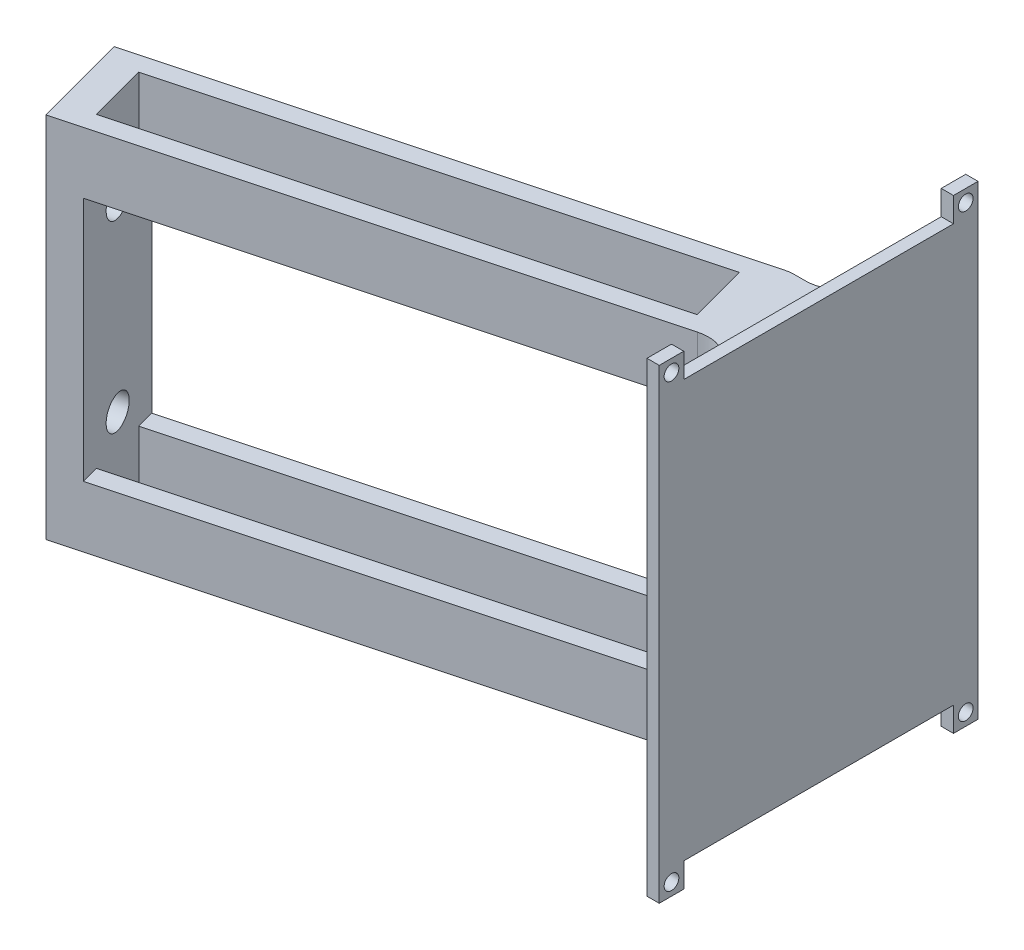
ISO-10303-21;
HEADER;
FILE_DESCRIPTION(('STEP AP214'),'2;1');
FILE_NAME('part.step','',(''),(''),'','','');
FILE_SCHEMA(('AUTOMOTIVE_DESIGN { 1 0 10303 214 1 1 1 1 }'));
ENDSEC;
DATA;
#1=APPLICATION_CONTEXT('core data for automotive mechanical design processes');
#2=APPLICATION_PROTOCOL_DEFINITION('international standard','automotive_design',2000,#1);
#3=PRODUCT_CONTEXT('',#1,'mechanical');
#4=PRODUCT('Part','Part','',(#3));
#5=PRODUCT_RELATED_PRODUCT_CATEGORY('part','',(#4));
#6=PRODUCT_DEFINITION_FORMATION('','',#4);
#7=PRODUCT_DEFINITION_CONTEXT('part definition',#1,'design');
#8=PRODUCT_DEFINITION('design','',#6,#7);
#9=PRODUCT_DEFINITION_SHAPE('','',#8);
#10=(LENGTH_UNIT() NAMED_UNIT(*) SI_UNIT(.MILLI.,.METRE.));
#11=(NAMED_UNIT(*) PLANE_ANGLE_UNIT() SI_UNIT($,.RADIAN.));
#12=(NAMED_UNIT(*) SI_UNIT($,.STERADIAN.) SOLID_ANGLE_UNIT());
#13=UNCERTAINTY_MEASURE_WITH_UNIT(LENGTH_MEASURE(1.E-05),#10,'distance_accuracy_value','');
#14=(GEOMETRIC_REPRESENTATION_CONTEXT(3) GLOBAL_UNCERTAINTY_ASSIGNED_CONTEXT((#13)) GLOBAL_UNIT_ASSIGNED_CONTEXT((#10,
#11,#12)) REPRESENTATION_CONTEXT('',''));
#15=CARTESIAN_POINT('',(0.,0.,0.));
#16=DIRECTION('',(0.,0.,1.));
#17=DIRECTION('',(1.,0.,0.));
#18=AXIS2_PLACEMENT_3D('',#15,#16,#17);
#19=CARTESIAN_POINT('',(-121.248512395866,0.,22.1356791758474));
#20=DIRECTION('',(-0.258819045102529,0.,-0.965925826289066));
#21=DIRECTION('',(-0.965925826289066,0.,0.258819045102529));
#22=AXIS2_PLACEMENT_3D('',#19,#20,#21);
#23=PLANE('',#22);
#24=DIRECTION('',(0.965925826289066,0.,-0.258819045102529));
#25=VECTOR('',#24,1.);
#26=CARTESIAN_POINT('',(-121.248512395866,38.1,22.1356791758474));
#27=LINE('',#26,#25);
#28=CARTESIAN_POINT('',(-121.248512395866,38.1,22.1356791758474));
#29=VERTEX_POINT('',#28);
#30=CARTESIAN_POINT('',(-11.8121995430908,38.1,-7.18769247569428));
#31=VERTEX_POINT('',#30);
#32=EDGE_CURVE('E395',#29,#31,#27,.T.);
#33=ORIENTED_EDGE('',*,*,#32,.T.);
#34=DIRECTION('',(0.,1.,0.));
#35=VECTOR('',#34,1.);
#36=CARTESIAN_POINT('',(-11.8121995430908,-38.1,-7.18769247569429));
#37=LINE('',#36,#35);
#38=CARTESIAN_POINT('',(-11.8121995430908,-38.1,-7.18769247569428));
#39=VERTEX_POINT('',#38);
#40=EDGE_CURVE('E621',#31,#39,#37,.F.);
#41=ORIENTED_EDGE('',*,*,#40,.T.);
#42=DIRECTION('',(0.965925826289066,0.,-0.258819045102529));
#43=VECTOR('',#42,1.);
#44=CARTESIAN_POINT('',(-121.248512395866,-38.1,22.1356791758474));
#45=LINE('',#44,#43);
#46=CARTESIAN_POINT('',(-121.248512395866,-38.1,22.1356791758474));
#47=VERTEX_POINT('',#46);
#48=EDGE_CURVE('E416',#47,#39,#45,.T.);
#49=ORIENTED_EDGE('',*,*,#48,.F.);
#50=DIRECTION('',(0.,1.,0.));
#51=VECTOR('',#50,1.);
#52=CARTESIAN_POINT('',(-121.248512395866,0.,22.1356791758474));
#53=LINE('',#52,#51);
#54=EDGE_CURVE('E373',#47,#29,#53,.T.);
#55=ORIENTED_EDGE('',*,*,#54,.T.);
#56=EDGE_LOOP('',(#33,#41,#49,#55));
#57=FACE_BOUND('',#56,.T.);
#58=DIRECTION('',(0.965925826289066,0.,-0.258819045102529));
#59=VECTOR('',#58,1.);
#60=CARTESIAN_POINT('',(-121.248512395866,25.4,22.1356791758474));
#61=LINE('',#60,#59);
#62=CARTESIAN_POINT('',(-115.11488339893,25.4,20.4921782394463));
#63=VERTEX_POINT('',#62);
#64=CARTESIAN_POINT('',(-16.9768194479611,25.4,-5.80383674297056));
#65=VERTEX_POINT('',#64);
#66=EDGE_CURVE('E256',#63,#65,#61,.T.);
#67=ORIENTED_EDGE('',*,*,#66,.F.);
#68=DIRECTION('',(0.,-1.,0.));
#69=VECTOR('',#68,1.);
#70=CARTESIAN_POINT('',(-115.11488339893,0.,20.4921782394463));
#71=LINE('',#70,#69);
#72=CARTESIAN_POINT('',(-115.11488339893,-25.4,20.4921782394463));
#73=VERTEX_POINT('',#72);
#74=EDGE_CURVE('E317',#63,#73,#71,.T.);
#75=ORIENTED_EDGE('',*,*,#74,.T.);
#76=DIRECTION('',(0.965925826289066,0.,-0.258819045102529));
#77=VECTOR('',#76,1.);
#78=CARTESIAN_POINT('',(-121.248512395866,-25.4,22.1356791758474));
#79=LINE('',#78,#77);
#80=CARTESIAN_POINT('',(-16.9768194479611,-25.4,-5.80383674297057));
#81=VERTEX_POINT('',#80);
#82=EDGE_CURVE('E284',#73,#81,#79,.T.);
#83=ORIENTED_EDGE('',*,*,#82,.T.);
#84=DIRECTION('',(0.,-1.,0.));
#85=VECTOR('',#84,1.);
#86=CARTESIAN_POINT('',(-16.9768194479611,0.,-5.80383674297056));
#87=LINE('',#86,#85);
#88=EDGE_CURVE('E276',#65,#81,#87,.T.);
#89=ORIENTED_EDGE('',*,*,#88,.F.);
#90=EDGE_LOOP('',(#67,#75,#83,#89));
#91=FACE_BOUND('',#90,.T.);
#92=ADVANCED_FACE('F47',(#57,#91),#23,.T.);
#93=CARTESIAN_POINT('',(-116.072131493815,0.,41.4541957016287));
#94=DIRECTION('',(-0.258819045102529,0.,-0.965925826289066));
#95=DIRECTION('',(-0.965925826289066,0.,0.258819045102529));
#96=AXIS2_PLACEMENT_3D('',#93,#94,#95);
#97=PLANE('',#96);
#98=DIRECTION('',(0.965925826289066,0.,-0.258819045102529));
#99=VECTOR('',#98,1.);
#100=CARTESIAN_POINT('',(-116.072131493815,-38.1,41.4541957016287));
#101=LINE('',#100,#99);
#102=CARTESIAN_POINT('',(-116.072131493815,-38.1,41.4541957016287));
#103=VERTEX_POINT('',#102);
#104=CARTESIAN_POINT('',(-9.59220112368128,-38.1,12.9229843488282));
#105=VERTEX_POINT('',#104);
#106=EDGE_CURVE('E412',#103,#105,#101,.T.);
#107=ORIENTED_EDGE('',*,*,#106,.T.);
#108=DIRECTION('',(0.,1.,0.));
#109=VECTOR('',#108,1.);
#110=CARTESIAN_POINT('',(-9.59220112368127,0.,12.9229843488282));
#111=LINE('',#110,#109);
#112=CARTESIAN_POINT('',(-9.59220112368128,38.1,12.9229843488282));
#113=VERTEX_POINT('',#112);
#114=EDGE_CURVE('E627',#105,#113,#111,.T.);
#115=ORIENTED_EDGE('',*,*,#114,.T.);
#116=DIRECTION('',(0.965925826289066,0.,-0.258819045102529));
#117=VECTOR('',#116,1.);
#118=CARTESIAN_POINT('',(-116.072131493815,38.1,41.4541957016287));
#119=LINE('',#118,#117);
#120=CARTESIAN_POINT('',(-116.072131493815,38.1,41.4541957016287));
#121=VERTEX_POINT('',#120);
#122=EDGE_CURVE('E408',#121,#113,#119,.T.);
#123=ORIENTED_EDGE('',*,*,#122,.F.);
#124=DIRECTION('',(0.,1.,0.));
#125=VECTOR('',#124,1.);
#126=CARTESIAN_POINT('',(-116.072131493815,0.,41.4541957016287));
#127=LINE('',#126,#125);
#128=EDGE_CURVE('E381',#103,#121,#127,.T.);
#129=ORIENTED_EDGE('',*,*,#128,.F.);
#130=EDGE_LOOP('',(#107,#115,#123,#129));
#131=FACE_BOUND('',#130,.T.);
#132=DIRECTION('',(0.,-1.,0.));
#133=VECTOR('',#132,1.);
#134=CARTESIAN_POINT('',(-109.93850249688,0.,39.8106947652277));
#135=LINE('',#134,#133);
#136=CARTESIAN_POINT('',(-109.93850249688,25.4,39.8106947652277));
#137=VERTEX_POINT('',#136);
#138=CARTESIAN_POINT('',(-109.93850249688,-25.4,39.8106947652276));
#139=VERTEX_POINT('',#138);
#140=EDGE_CURVE('E267',#137,#139,#135,.T.);
#141=ORIENTED_EDGE('',*,*,#140,.F.);
#142=DIRECTION('',(0.965925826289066,0.,-0.258819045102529));
#143=VECTOR('',#142,1.);
#144=CARTESIAN_POINT('',(-116.072131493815,25.4,41.4541957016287));
#145=LINE('',#144,#143);
#146=CARTESIAN_POINT('',(-11.8004385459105,25.4,13.5146797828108));
#147=VERTEX_POINT('',#146);
#148=EDGE_CURVE('E268',#137,#147,#145,.T.);
#149=ORIENTED_EDGE('',*,*,#148,.T.);
#150=DIRECTION('',(0.,-1.,0.));
#151=VECTOR('',#150,1.);
#152=CARTESIAN_POINT('',(-11.8004385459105,0.,13.5146797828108));
#153=LINE('',#152,#151);
#154=CARTESIAN_POINT('',(-11.8004385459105,-25.4,13.5146797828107));
#155=VERTEX_POINT('',#154);
#156=EDGE_CURVE('E287',#147,#155,#153,.T.);
#157=ORIENTED_EDGE('',*,*,#156,.T.);
#158=DIRECTION('',(0.965925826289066,0.,-0.258819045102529));
#159=VECTOR('',#158,1.);
#160=CARTESIAN_POINT('',(-116.072131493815,-25.4,41.4541957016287));
#161=LINE('',#160,#159);
#162=EDGE_CURVE('E299',#139,#155,#161,.T.);
#163=ORIENTED_EDGE('',*,*,#162,.F.);
#164=EDGE_LOOP('',(#141,#149,#157,#163));
#165=FACE_BOUND('',#164,.T.);
#166=ADVANCED_FACE('F668',(#131,#165),#97,.F.);
#167=CARTESIAN_POINT('',(-12.7865391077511,-48.26,9.83450238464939));
#168=DIRECTION('',(0.258819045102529,0.,0.965925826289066));
#169=DIRECTION('',(0.965925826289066,0.,-0.258819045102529));
#170=AXIS2_PLACEMENT_3D('',#167,#168,#169);
#171=PLANE('',#170);
#172=DIRECTION('',(-0.965925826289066,0.,0.258819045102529));
#173=VECTOR('',#172,1.);
#174=CARTESIAN_POINT('',(-12.7865391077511,-25.4,9.8345023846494));
#175=LINE('',#174,#173);
#176=CARTESIAN_POINT('',(-12.7865391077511,-25.4,9.83450238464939));
#177=VERTEX_POINT('',#176);
#178=CARTESIAN_POINT('',(-110.92460305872,-25.4,36.1305173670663));
#179=VERTEX_POINT('',#178);
#180=EDGE_CURVE('E291',#177,#179,#175,.T.);
#181=ORIENTED_EDGE('',*,*,#180,.F.);
#182=DIRECTION('',(0.,1.,0.));
#183=VECTOR('',#182,1.);
#184=CARTESIAN_POINT('',(-12.7865391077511,-48.26,9.83450238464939));
#185=LINE('',#184,#183);
#186=CARTESIAN_POINT('',(-12.7865391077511,-38.1,9.83450238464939));
#187=VERTEX_POINT('',#186);
#188=EDGE_CURVE('E335',#187,#177,#185,.T.);
#189=ORIENTED_EDGE('',*,*,#188,.F.);
#190=DIRECTION('',(0.965925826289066,0.,-0.258819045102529));
#191=VECTOR('',#190,1.);
#192=CARTESIAN_POINT('',(74.552748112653,-38.1,-13.5679890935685));
#193=LINE('',#192,#191);
#194=CARTESIAN_POINT('',(-110.92460305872,-38.1,36.1305173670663));
#195=VERTEX_POINT('',#194);
#196=EDGE_CURVE('E598',#195,#187,#193,.T.);
#197=ORIENTED_EDGE('',*,*,#196,.F.);
#198=DIRECTION('',(0.,1.,0.));
#199=VECTOR('',#198,1.);
#200=CARTESIAN_POINT('',(-110.92460305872,-48.26,36.1305173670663));
#201=LINE('',#200,#199);
#202=EDGE_CURVE('E341',#195,#179,#201,.T.);
#203=ORIENTED_EDGE('',*,*,#202,.T.);
#204=EDGE_LOOP('',(#181,#189,#197,#203));
#205=FACE_BOUND('',#204,.T.);
#206=ADVANCED_FACE('F671',(#205),#171,.F.);
#207=CARTESIAN_POINT('',(-15.9907188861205,-48.26,-2.1236593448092));
#208=DIRECTION('',(-0.258819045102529,0.,-0.965925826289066));
#209=DIRECTION('',(-0.965925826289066,0.,0.258819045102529));
#210=AXIS2_PLACEMENT_3D('',#207,#208,#209);
#211=PLANE('',#210);
#212=DIRECTION('',(0.965925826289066,0.,-0.258819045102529));
#213=VECTOR('',#212,1.);
#214=CARTESIAN_POINT('',(-15.9907188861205,-25.4,-2.1236593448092));
#215=LINE('',#214,#213);
#216=CARTESIAN_POINT('',(-114.12878283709,-25.4,24.1723556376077));
#217=VERTEX_POINT('',#216);
#218=CARTESIAN_POINT('',(-15.9907188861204,-25.4,-2.12365934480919));
#219=VERTEX_POINT('',#218);
#220=EDGE_CURVE('E286',#217,#219,#215,.T.);
#221=ORIENTED_EDGE('',*,*,#220,.F.);
#222=DIRECTION('',(0.,1.,0.));
#223=VECTOR('',#222,1.);
#224=CARTESIAN_POINT('',(-114.12878283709,-48.26,24.1723556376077));
#225=LINE('',#224,#223);
#226=CARTESIAN_POINT('',(-114.12878283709,-38.1,24.1723556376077));
#227=VERTEX_POINT('',#226);
#228=EDGE_CURVE('E346',#227,#217,#225,.T.);
#229=ORIENTED_EDGE('',*,*,#228,.F.);
#230=DIRECTION('',(-0.965925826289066,0.,0.258819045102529));
#231=VECTOR('',#230,1.);
#232=CARTESIAN_POINT('',(71.3485683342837,-38.1,-25.5261508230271));
#233=LINE('',#232,#231);
#234=CARTESIAN_POINT('',(-15.9907188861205,-38.1,-2.1236593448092));
#235=VERTEX_POINT('',#234);
#236=EDGE_CURVE('E403',#235,#227,#233,.T.);
#237=ORIENTED_EDGE('',*,*,#236,.F.);
#238=DIRECTION('',(0.,1.,0.));
#239=VECTOR('',#238,1.);
#240=CARTESIAN_POINT('',(-15.9907188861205,-48.26,-2.1236593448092));
#241=LINE('',#240,#239);
#242=EDGE_CURVE('E351',#235,#219,#241,.T.);
#243=ORIENTED_EDGE('',*,*,#242,.T.);
#244=EDGE_LOOP('',(#221,#229,#237,#243));
#245=FACE_BOUND('',#244,.T.);
#246=ADVANCED_FACE('F703',(#245),#211,.F.);
#247=CARTESIAN_POINT('',(0.,0.,0.));
#248=DIRECTION('',(1.,0.,0.));
#249=DIRECTION('',(0.,0.,-1.));
#250=AXIS2_PLACEMENT_3D('',#247,#248,#249);
#251=PLANE('',#250);
#252=CARTESIAN_POINT('',(0.,45.72,-30.48));
#253=DIRECTION('',(1.,0.,0.));
#254=DIRECTION('',(0.,0.,-1.));
#255=AXIS2_PLACEMENT_3D('',#252,#253,#254);
#256=CIRCLE('',#255,1.524);
#257=CARTESIAN_POINT('',(0.,45.72,-32.004));
#258=VERTEX_POINT('',#257);
#259=EDGE_CURVE('E437',#258,#258,#256,.T.);
#260=ORIENTED_EDGE('',*,*,#259,.T.);
#261=EDGE_LOOP('',(#260));
#262=FACE_BOUND('',#261,.T.);
#263=CARTESIAN_POINT('',(0.,-45.72,-30.48));
#264=DIRECTION('',(1.,0.,0.));
#265=DIRECTION('',(0.,0.,-1.));
#266=AXIS2_PLACEMENT_3D('',#263,#264,#265);
#267=CIRCLE('',#266,1.524);
#268=CARTESIAN_POINT('',(0.,-45.72,-32.004));
#269=VERTEX_POINT('',#268);
#270=EDGE_CURVE('E545',#269,#269,#267,.F.);
#271=ORIENTED_EDGE('',*,*,#270,.F.);
#272=EDGE_LOOP('',(#271));
#273=FACE_BOUND('',#272,.T.);
#274=CARTESIAN_POINT('',(0.,45.72,30.48));
#275=DIRECTION('',(1.,0.,0.));
#276=DIRECTION('',(0.,0.,-1.));
#277=AXIS2_PLACEMENT_3D('',#274,#275,#276);
#278=CIRCLE('',#277,1.524);
#279=CARTESIAN_POINT('',(0.,45.72,28.956));
#280=VERTEX_POINT('',#279);
#281=EDGE_CURVE('E541',#280,#280,#278,.F.);
#282=ORIENTED_EDGE('',*,*,#281,.F.);
#283=EDGE_LOOP('',(#282));
#284=FACE_BOUND('',#283,.T.);
#285=CARTESIAN_POINT('',(0.,-45.72,30.48));
#286=DIRECTION('',(1.,0.,0.));
#287=DIRECTION('',(0.,0.,-1.));
#288=AXIS2_PLACEMENT_3D('',#285,#286,#287);
#289=CIRCLE('',#288,1.524);
#290=CARTESIAN_POINT('',(0.,-45.72,28.956));
#291=VERTEX_POINT('',#290);
#292=EDGE_CURVE('E537',#291,#291,#289,.T.);
#293=ORIENTED_EDGE('',*,*,#292,.T.);
#294=EDGE_LOOP('',(#293));
#295=FACE_BOUND('',#294,.T.);
#296=DIRECTION('',(0.,1.,0.));
#297=VECTOR('',#296,1.);
#298=CARTESIAN_POINT('',(0.,0.,27.94));
#299=LINE('',#298,#297);
#300=CARTESIAN_POINT('',(0.,-48.26,27.94));
#301=VERTEX_POINT('',#300);
#302=CARTESIAN_POINT('',(0.,-43.18,27.94));
#303=VERTEX_POINT('',#302);
#304=EDGE_CURVE('E426',#301,#303,#299,.T.);
#305=ORIENTED_EDGE('',*,*,#304,.F.);
#306=DIRECTION('',(0.,0.,1.));
#307=VECTOR('',#306,1.);
#308=CARTESIAN_POINT('',(0.,-48.26,0.));
#309=LINE('',#308,#307);
#310=CARTESIAN_POINT('',(0.,-48.26,33.02));
#311=VERTEX_POINT('',#310);
#312=EDGE_CURVE('E533',#301,#311,#309,.T.);
#313=ORIENTED_EDGE('',*,*,#312,.T.);
#314=DIRECTION('',(0.,1.,0.));
#315=VECTOR('',#314,1.);
#316=CARTESIAN_POINT('',(0.,0.,33.02));
#317=LINE('',#316,#315);
#318=CARTESIAN_POINT('',(0.,48.26,33.02));
#319=VERTEX_POINT('',#318);
#320=EDGE_CURVE('E529',#311,#319,#317,.T.);
#321=ORIENTED_EDGE('',*,*,#320,.T.);
#322=DIRECTION('',(0.,0.,1.));
#323=VECTOR('',#322,1.);
#324=CARTESIAN_POINT('',(0.,48.26,0.));
#325=LINE('',#324,#323);
#326=CARTESIAN_POINT('',(0.,48.26,27.94));
#327=VERTEX_POINT('',#326);
#328=EDGE_CURVE('E525',#327,#319,#325,.T.);
#329=ORIENTED_EDGE('',*,*,#328,.F.);
#330=DIRECTION('',(0.,-1.,0.));
#331=VECTOR('',#330,1.);
#332=CARTESIAN_POINT('',(0.,0.,27.94));
#333=LINE('',#332,#331);
#334=CARTESIAN_POINT('',(0.,43.18,27.94));
#335=VERTEX_POINT('',#334);
#336=EDGE_CURVE('E521',#327,#335,#333,.T.);
#337=ORIENTED_EDGE('',*,*,#336,.T.);
#338=DIRECTION('',(0.,0.,1.));
#339=VECTOR('',#338,1.);
#340=CARTESIAN_POINT('',(0.,43.18,0.));
#341=LINE('',#340,#339);
#342=CARTESIAN_POINT('',(0.,43.18,-27.94));
#343=VERTEX_POINT('',#342);
#344=EDGE_CURVE('E517',#343,#335,#341,.T.);
#345=ORIENTED_EDGE('',*,*,#344,.F.);
#346=DIRECTION('',(0.,-1.,0.));
#347=VECTOR('',#346,1.);
#348=CARTESIAN_POINT('',(0.,0.,-27.9399999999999));
#349=LINE('',#348,#347);
#350=CARTESIAN_POINT('',(0.,48.26,-27.94));
#351=VERTEX_POINT('',#350);
#352=EDGE_CURVE('E514',#351,#343,#349,.T.);
#353=ORIENTED_EDGE('',*,*,#352,.F.);
#354=DIRECTION('',(0.,0.,1.));
#355=VECTOR('',#354,1.);
#356=CARTESIAN_POINT('',(0.,48.26,0.));
#357=LINE('',#356,#355);
#358=CARTESIAN_POINT('',(0.,48.26,-33.02));
#359=VERTEX_POINT('',#358);
#360=EDGE_CURVE('E511',#359,#351,#357,.T.);
#361=ORIENTED_EDGE('',*,*,#360,.F.);
#362=DIRECTION('',(0.,1.,0.));
#363=VECTOR('',#362,1.);
#364=CARTESIAN_POINT('',(0.,0.,-33.02));
#365=LINE('',#364,#363);
#366=CARTESIAN_POINT('',(0.,-48.26,-33.02));
#367=VERTEX_POINT('',#366);
#368=EDGE_CURVE('E508',#367,#359,#365,.T.);
#369=ORIENTED_EDGE('',*,*,#368,.F.);
#370=DIRECTION('',(0.,0.,1.));
#371=VECTOR('',#370,1.);
#372=CARTESIAN_POINT('',(0.,-48.26,0.));
#373=LINE('',#372,#371);
#374=CARTESIAN_POINT('',(0.,-48.26,-27.94));
#375=VERTEX_POINT('',#374);
#376=EDGE_CURVE('E504',#367,#375,#373,.T.);
#377=ORIENTED_EDGE('',*,*,#376,.T.);
#378=DIRECTION('',(0.,1.,0.));
#379=VECTOR('',#378,1.);
#380=CARTESIAN_POINT('',(0.,0.,-27.9399999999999));
#381=LINE('',#380,#379);
#382=CARTESIAN_POINT('',(0.,-43.18,-27.94));
#383=VERTEX_POINT('',#382);
#384=EDGE_CURVE('E500',#375,#383,#381,.T.);
#385=ORIENTED_EDGE('',*,*,#384,.T.);
#386=DIRECTION('',(0.,0.,1.));
#387=VECTOR('',#386,1.);
#388=CARTESIAN_POINT('',(0.,-43.18,0.));
#389=LINE('',#388,#387);
#390=EDGE_CURVE('E496',#383,#303,#389,.T.);
#391=ORIENTED_EDGE('',*,*,#390,.T.);
#392=EDGE_LOOP('',(#305,#313,#321,#329,#337,#345,#353,#361,#369,#377,#385,#391));
#393=FACE_BOUND('',#392,.T.);
#394=DIRECTION('',(0.,0.,-1.));
#395=VECTOR('',#394,1.);
#396=CARTESIAN_POINT('',(0.,38.1,2.21192058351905));
#397=LINE('',#396,#395);
#398=CARTESIAN_POINT('',(0.,38.1,20.2833391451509));
#399=VERTEX_POINT('',#398);
#400=CARTESIAN_POINT('',(0.,38.1,-15.0673376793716));
#401=VERTEX_POINT('',#400);
#402=EDGE_CURVE('E63',#399,#401,#397,.T.);
#403=ORIENTED_EDGE('',*,*,#402,.F.);
#404=DIRECTION('',(0.,1.,0.));
#405=VECTOR('',#404,1.);
#406=CARTESIAN_POINT('',(0.,0.,20.2833391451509));
#407=LINE('',#406,#405);
#408=CARTESIAN_POINT('',(0.,-38.1,20.2833391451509));
#409=VERTEX_POINT('',#408);
#410=EDGE_CURVE('E631',#399,#409,#407,.F.);
#411=ORIENTED_EDGE('',*,*,#410,.T.);
#412=DIRECTION('',(0.,0.,-1.));
#413=VECTOR('',#412,1.);
#414=CARTESIAN_POINT('',(0.,-38.1,2.21192058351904));
#415=LINE('',#414,#413);
#416=CARTESIAN_POINT('',(0.,-38.1,-15.0673376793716));
#417=VERTEX_POINT('',#416);
#418=EDGE_CURVE('E70',#409,#417,#415,.T.);
#419=ORIENTED_EDGE('',*,*,#418,.T.);
#420=DIRECTION('',(0.,1.,0.));
#421=VECTOR('',#420,1.);
#422=CARTESIAN_POINT('',(0.,38.1,-15.0673376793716));
#423=LINE('',#422,#421);
#424=EDGE_CURVE('E602',#417,#401,#423,.T.);
#425=ORIENTED_EDGE('',*,*,#424,.T.);
#426=EDGE_LOOP('',(#403,#411,#419,#425));
#427=FACE_BOUND('',#426,.T.);
#428=ADVANCED_FACE('F643',(#262,#273,#284,#295,#393,#427),#251,.F.);
#429=CARTESIAN_POINT('',(2.54,0.,27.94));
#430=DIRECTION('',(0.,0.,1.));
#431=DIRECTION('',(1.,0.,0.));
#432=AXIS2_PLACEMENT_3D('',#429,#430,#431);
#433=PLANE('',#432);
#434=ORIENTED_EDGE('',*,*,#304,.T.);
#435=DIRECTION('',(-1.,0.,0.));
#436=VECTOR('',#435,1.);
#437=CARTESIAN_POINT('',(2.54,-43.18,27.94));
#438=LINE('',#437,#436);
#439=CARTESIAN_POINT('',(2.54,-43.18,27.94));
#440=VERTEX_POINT('',#439);
#441=EDGE_CURVE('E404',#440,#303,#438,.T.);
#442=ORIENTED_EDGE('',*,*,#441,.F.);
#443=DIRECTION('',(0.,1.,0.));
#444=VECTOR('',#443,1.);
#445=CARTESIAN_POINT('',(2.54,0.,27.94));
#446=LINE('',#445,#444);
#447=CARTESIAN_POINT('',(2.54,-48.26,27.94));
#448=VERTEX_POINT('',#447);
#449=EDGE_CURVE('E433',#448,#440,#446,.T.);
#450=ORIENTED_EDGE('',*,*,#449,.F.);
#451=DIRECTION('',(-1.,0.,0.));
#452=VECTOR('',#451,1.);
#453=CARTESIAN_POINT('',(2.54,-48.26,27.94));
#454=LINE('',#453,#452);
#455=EDGE_CURVE('E492',#448,#301,#454,.T.);
#456=ORIENTED_EDGE('',*,*,#455,.T.);
#457=EDGE_LOOP('',(#434,#442,#450,#456));
#458=FACE_BOUND('',#457,.T.);
#459=ADVANCED_FACE('F933',(#458),#433,.F.);
#460=CARTESIAN_POINT('',(2.54,-43.18,0.));
#461=DIRECTION('',(0.,-1.,0.));
#462=DIRECTION('',(0.,0.,-1.));
#463=AXIS2_PLACEMENT_3D('',#460,#461,#462);
#464=PLANE('',#463);
#465=ORIENTED_EDGE('',*,*,#390,.F.);
#466=DIRECTION('',(-1.,0.,0.));
#467=VECTOR('',#466,1.);
#468=CARTESIAN_POINT('',(2.54,-43.18,-27.94));
#469=LINE('',#468,#467);
#470=CARTESIAN_POINT('',(2.54,-43.18,-27.94));
#471=VERTEX_POINT('',#470);
#472=EDGE_CURVE('E584',#471,#383,#469,.T.);
#473=ORIENTED_EDGE('',*,*,#472,.F.);
#474=DIRECTION('',(0.,0.,1.));
#475=VECTOR('',#474,1.);
#476=CARTESIAN_POINT('',(2.54,-43.18,0.));
#477=LINE('',#476,#475);
#478=EDGE_CURVE('E436',#471,#440,#477,.T.);
#479=ORIENTED_EDGE('',*,*,#478,.T.);
#480=ORIENTED_EDGE('',*,*,#441,.T.);
#481=EDGE_LOOP('',(#465,#473,#479,#480));
#482=FACE_BOUND('',#481,.T.);
#483=ADVANCED_FACE('F1079',(#482),#464,.T.);
#484=CARTESIAN_POINT('',(2.54,0.,-27.9399999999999));
#485=DIRECTION('',(0.,0.,1.));
#486=DIRECTION('',(0.,-1.,0.));
#487=AXIS2_PLACEMENT_3D('',#484,#485,#486);
#488=PLANE('',#487);
#489=ORIENTED_EDGE('',*,*,#384,.F.);
#490=DIRECTION('',(-1.,0.,0.));
#491=VECTOR('',#490,1.);
#492=CARTESIAN_POINT('',(2.54,-48.26,-27.94));
#493=LINE('',#492,#491);
#494=CARTESIAN_POINT('',(2.54,-48.26,-27.94));
#495=VERTEX_POINT('',#494);
#496=EDGE_CURVE('E581',#495,#375,#493,.T.);
#497=ORIENTED_EDGE('',*,*,#496,.F.);
#498=DIRECTION('',(0.,1.,0.));
#499=VECTOR('',#498,1.);
#500=CARTESIAN_POINT('',(2.54,0.,-27.9399999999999));
#501=LINE('',#500,#499);
#502=EDGE_CURVE('E441',#495,#471,#501,.T.);
#503=ORIENTED_EDGE('',*,*,#502,.T.);
#504=ORIENTED_EDGE('',*,*,#472,.T.);
#505=EDGE_LOOP('',(#489,#497,#503,#504));
#506=FACE_BOUND('',#505,.T.);
#507=ADVANCED_FACE('F1070',(#506),#488,.T.);
#508=CARTESIAN_POINT('',(2.54,-48.26,0.));
#509=DIRECTION('',(0.,-1.,0.));
#510=DIRECTION('',(0.,0.,-1.));
#511=AXIS2_PLACEMENT_3D('',#508,#509,#510);
#512=PLANE('',#511);
#513=ORIENTED_EDGE('',*,*,#376,.F.);
#514=DIRECTION('',(-1.,0.,0.));
#515=VECTOR('',#514,1.);
#516=CARTESIAN_POINT('',(2.54,-48.26,-33.02));
#517=LINE('',#516,#515);
#518=CARTESIAN_POINT('',(2.54,-48.26,-33.02));
#519=VERTEX_POINT('',#518);
#520=EDGE_CURVE('E578',#519,#367,#517,.T.);
#521=ORIENTED_EDGE('',*,*,#520,.F.);
#522=DIRECTION('',(0.,0.,1.));
#523=VECTOR('',#522,1.);
#524=CARTESIAN_POINT('',(2.54,-48.26,0.));
#525=LINE('',#524,#523);
#526=EDGE_CURVE('E445',#519,#495,#525,.T.);
#527=ORIENTED_EDGE('',*,*,#526,.T.);
#528=ORIENTED_EDGE('',*,*,#496,.T.);
#529=EDGE_LOOP('',(#513,#521,#527,#528));
#530=FACE_BOUND('',#529,.T.);
#531=ADVANCED_FACE('F1059',(#530),#512,.T.);
#532=CARTESIAN_POINT('',(2.54,0.,-33.02));
#533=DIRECTION('',(0.,0.,1.));
#534=DIRECTION('',(1.,0.,0.));
#535=AXIS2_PLACEMENT_3D('',#532,#533,#534);
#536=PLANE('',#535);
#537=ORIENTED_EDGE('',*,*,#368,.T.);
#538=DIRECTION('',(-1.,0.,0.));
#539=VECTOR('',#538,1.);
#540=CARTESIAN_POINT('',(2.54,48.26,-33.02));
#541=LINE('',#540,#539);
#542=CARTESIAN_POINT('',(2.54,48.26,-33.02));
#543=VERTEX_POINT('',#542);
#544=EDGE_CURVE('E574',#543,#359,#541,.T.);
#545=ORIENTED_EDGE('',*,*,#544,.F.);
#546=DIRECTION('',(0.,1.,0.));
#547=VECTOR('',#546,1.);
#548=CARTESIAN_POINT('',(2.54,0.,-33.02));
#549=LINE('',#548,#547);
#550=EDGE_CURVE('E449',#519,#543,#549,.T.);
#551=ORIENTED_EDGE('',*,*,#550,.F.);
#552=ORIENTED_EDGE('',*,*,#520,.T.);
#553=EDGE_LOOP('',(#537,#545,#551,#552));
#554=FACE_BOUND('',#553,.T.);
#555=ADVANCED_FACE('F1049',(#554),#536,.F.);
#556=CARTESIAN_POINT('',(2.54,48.26,0.));
#557=DIRECTION('',(0.,-1.,0.));
#558=DIRECTION('',(0.,0.,-1.));
#559=AXIS2_PLACEMENT_3D('',#556,#557,#558);
#560=PLANE('',#559);
#561=ORIENTED_EDGE('',*,*,#360,.T.);
#562=DIRECTION('',(-1.,0.,0.));
#563=VECTOR('',#562,1.);
#564=CARTESIAN_POINT('',(2.54,48.26,-27.94));
#565=LINE('',#564,#563);
#566=CARTESIAN_POINT('',(2.54,48.26,-27.94));
#567=VERTEX_POINT('',#566);
#568=EDGE_CURVE('E570',#567,#351,#565,.T.);
#569=ORIENTED_EDGE('',*,*,#568,.F.);
#570=DIRECTION('',(0.,0.,1.));
#571=VECTOR('',#570,1.);
#572=CARTESIAN_POINT('',(2.54,48.26,0.));
#573=LINE('',#572,#571);
#574=EDGE_CURVE('E452',#543,#567,#573,.T.);
#575=ORIENTED_EDGE('',*,*,#574,.F.);
#576=ORIENTED_EDGE('',*,*,#544,.T.);
#577=EDGE_LOOP('',(#561,#569,#575,#576));
#578=FACE_BOUND('',#577,.T.);
#579=ADVANCED_FACE('F1039',(#578),#560,.F.);
#580=CARTESIAN_POINT('',(2.54,0.,-27.9399999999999));
#581=DIRECTION('',(0.,0.,-1.));
#582=DIRECTION('',(0.,1.,0.));
#583=AXIS2_PLACEMENT_3D('',#580,#581,#582);
#584=PLANE('',#583);
#585=ORIENTED_EDGE('',*,*,#352,.T.);
#586=DIRECTION('',(-1.,0.,0.));
#587=VECTOR('',#586,1.);
#588=CARTESIAN_POINT('',(2.54,43.18,-27.94));
#589=LINE('',#588,#587);
#590=CARTESIAN_POINT('',(2.54,43.18,-27.94));
#591=VERTEX_POINT('',#590);
#592=EDGE_CURVE('E566',#591,#343,#589,.T.);
#593=ORIENTED_EDGE('',*,*,#592,.F.);
#594=DIRECTION('',(0.,-1.,0.));
#595=VECTOR('',#594,1.);
#596=CARTESIAN_POINT('',(2.54,0.,-27.9399999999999));
#597=LINE('',#596,#595);
#598=EDGE_CURVE('E455',#567,#591,#597,.T.);
#599=ORIENTED_EDGE('',*,*,#598,.F.);
#600=ORIENTED_EDGE('',*,*,#568,.T.);
#601=EDGE_LOOP('',(#585,#593,#599,#600));
#602=FACE_BOUND('',#601,.T.);
#603=ADVANCED_FACE('F1030',(#602),#584,.F.);
#604=CARTESIAN_POINT('',(2.54,43.18,0.));
#605=DIRECTION('',(0.,-1.,0.));
#606=DIRECTION('',(0.,0.,-1.));
#607=AXIS2_PLACEMENT_3D('',#604,#605,#606);
#608=PLANE('',#607);
#609=ORIENTED_EDGE('',*,*,#344,.T.);
#610=DIRECTION('',(-1.,0.,0.));
#611=VECTOR('',#610,1.);
#612=CARTESIAN_POINT('',(2.54,43.18,27.94));
#613=LINE('',#612,#611);
#614=CARTESIAN_POINT('',(2.54,43.18,27.94));
#615=VERTEX_POINT('',#614);
#616=EDGE_CURVE('E563',#615,#335,#613,.T.);
#617=ORIENTED_EDGE('',*,*,#616,.F.);
#618=DIRECTION('',(0.,0.,1.));
#619=VECTOR('',#618,1.);
#620=CARTESIAN_POINT('',(2.54,43.18,0.));
#621=LINE('',#620,#619);
#622=EDGE_CURVE('E458',#591,#615,#621,.T.);
#623=ORIENTED_EDGE('',*,*,#622,.F.);
#624=ORIENTED_EDGE('',*,*,#592,.T.);
#625=EDGE_LOOP('',(#609,#617,#623,#624));
#626=FACE_BOUND('',#625,.T.);
#627=ADVANCED_FACE('F1021',(#626),#608,.F.);
#628=CARTESIAN_POINT('',(2.54,0.,27.94));
#629=DIRECTION('',(0.,0.,-1.));
#630=DIRECTION('',(-1.,0.,0.));
#631=AXIS2_PLACEMENT_3D('',#628,#629,#630);
#632=PLANE('',#631);
#633=ORIENTED_EDGE('',*,*,#336,.F.);
#634=DIRECTION('',(-1.,0.,0.));
#635=VECTOR('',#634,1.);
#636=CARTESIAN_POINT('',(2.54,48.26,27.94));
#637=LINE('',#636,#635);
#638=CARTESIAN_POINT('',(2.54,48.26,27.94));
#639=VERTEX_POINT('',#638);
#640=EDGE_CURVE('E560',#639,#327,#637,.T.);
#641=ORIENTED_EDGE('',*,*,#640,.F.);
#642=DIRECTION('',(0.,-1.,0.));
#643=VECTOR('',#642,1.);
#644=CARTESIAN_POINT('',(2.54,0.,27.94));
#645=LINE('',#644,#643);
#646=EDGE_CURVE('E461',#639,#615,#645,.T.);
#647=ORIENTED_EDGE('',*,*,#646,.T.);
#648=ORIENTED_EDGE('',*,*,#616,.T.);
#649=EDGE_LOOP('',(#633,#641,#647,#648));
#650=FACE_BOUND('',#649,.T.);
#651=ADVANCED_FACE('F1012',(#650),#632,.T.);
#652=CARTESIAN_POINT('',(2.54,48.26,0.));
#653=DIRECTION('',(0.,-1.,0.));
#654=DIRECTION('',(0.,0.,-1.));
#655=AXIS2_PLACEMENT_3D('',#652,#653,#654);
#656=PLANE('',#655);
#657=ORIENTED_EDGE('',*,*,#328,.T.);
#658=DIRECTION('',(-1.,0.,0.));
#659=VECTOR('',#658,1.);
#660=CARTESIAN_POINT('',(2.54,48.26,33.02));
#661=LINE('',#660,#659);
#662=CARTESIAN_POINT('',(2.54,48.26,33.02));
#663=VERTEX_POINT('',#662);
#664=EDGE_CURVE('E557',#663,#319,#661,.T.);
#665=ORIENTED_EDGE('',*,*,#664,.F.);
#666=DIRECTION('',(0.,0.,1.));
#667=VECTOR('',#666,1.);
#668=CARTESIAN_POINT('',(2.54,48.26,0.));
#669=LINE('',#668,#667);
#670=EDGE_CURVE('E465',#639,#663,#669,.T.);
#671=ORIENTED_EDGE('',*,*,#670,.F.);
#672=ORIENTED_EDGE('',*,*,#640,.T.);
#673=EDGE_LOOP('',(#657,#665,#671,#672));
#674=FACE_BOUND('',#673,.T.);
#675=ADVANCED_FACE('F1001',(#674),#656,.F.);
#676=CARTESIAN_POINT('',(2.54,0.,33.02));
#677=DIRECTION('',(0.,0.,1.));
#678=DIRECTION('',(1.,0.,0.));
#679=AXIS2_PLACEMENT_3D('',#676,#677,#678);
#680=PLANE('',#679);
#681=ORIENTED_EDGE('',*,*,#320,.F.);
#682=DIRECTION('',(-1.,0.,0.));
#683=VECTOR('',#682,1.);
#684=CARTESIAN_POINT('',(2.54,-48.26,33.02));
#685=LINE('',#684,#683);
#686=CARTESIAN_POINT('',(2.54,-48.26,33.02));
#687=VERTEX_POINT('',#686);
#688=EDGE_CURVE('E554',#687,#311,#685,.T.);
#689=ORIENTED_EDGE('',*,*,#688,.F.);
#690=DIRECTION('',(0.,1.,0.));
#691=VECTOR('',#690,1.);
#692=CARTESIAN_POINT('',(2.54,0.,33.02));
#693=LINE('',#692,#691);
#694=EDGE_CURVE('E468',#687,#663,#693,.T.);
#695=ORIENTED_EDGE('',*,*,#694,.T.);
#696=ORIENTED_EDGE('',*,*,#664,.T.);
#697=EDGE_LOOP('',(#681,#689,#695,#696));
#698=FACE_BOUND('',#697,.T.);
#699=ADVANCED_FACE('F991',(#698),#680,.T.);
#700=CARTESIAN_POINT('',(2.54,-45.72,-30.48));
#701=DIRECTION('',(-1.,0.,0.));
#702=DIRECTION('',(0.,0.,1.));
#703=AXIS2_PLACEMENT_3D('',#700,#701,#702);
#704=CYLINDRICAL_SURFACE('',#703,1.524);
#705=CARTESIAN_POINT('',(2.54,-45.72,-30.48));
#706=DIRECTION('',(1.,0.,0.));
#707=DIRECTION('',(0.,0.,-1.));
#708=AXIS2_PLACEMENT_3D('',#705,#706,#707);
#709=CIRCLE('',#708,1.524);
#710=CARTESIAN_POINT('',(2.54,-45.72,-32.004));
#711=VERTEX_POINT('',#710);
#712=EDGE_CURVE('E484',#711,#711,#709,.F.);
#713=ORIENTED_EDGE('',*,*,#712,.F.);
#714=EDGE_LOOP('',(#713));
#715=FACE_BOUND('',#714,.T.);
#716=ORIENTED_EDGE('',*,*,#270,.T.);
#717=EDGE_LOOP('',(#716));
#718=FACE_BOUND('',#717,.T.);
#719=ADVANCED_FACE('F982',(#715,#718),#704,.F.);
#720=CARTESIAN_POINT('',(2.54,45.72,30.48));
#721=DIRECTION('',(-1.,0.,0.));
#722=DIRECTION('',(0.,0.,1.));
#723=AXIS2_PLACEMENT_3D('',#720,#721,#722);
#724=CYLINDRICAL_SURFACE('',#723,1.524);
#725=CARTESIAN_POINT('',(2.54,45.72,30.48));
#726=DIRECTION('',(1.,0.,0.));
#727=DIRECTION('',(0.,0.,-1.));
#728=AXIS2_PLACEMENT_3D('',#725,#726,#727);
#729=CIRCLE('',#728,1.524);
#730=CARTESIAN_POINT('',(2.54,45.72,28.956));
#731=VERTEX_POINT('',#730);
#732=EDGE_CURVE('E480',#731,#731,#729,.F.);
#733=ORIENTED_EDGE('',*,*,#732,.F.);
#734=EDGE_LOOP('',(#733));
#735=FACE_BOUND('',#734,.T.);
#736=ORIENTED_EDGE('',*,*,#281,.T.);
#737=EDGE_LOOP('',(#736));
#738=FACE_BOUND('',#737,.T.);
#739=ADVANCED_FACE('F973',(#735,#738),#724,.F.);
#740=CARTESIAN_POINT('',(2.54,-45.72,30.48));
#741=DIRECTION('',(-1.,0.,0.));
#742=DIRECTION('',(0.,0.,1.));
#743=AXIS2_PLACEMENT_3D('',#740,#741,#742);
#744=CYLINDRICAL_SURFACE('',#743,1.524);
#745=CARTESIAN_POINT('',(2.54,-45.72,30.48));
#746=DIRECTION('',(1.,0.,0.));
#747=DIRECTION('',(0.,0.,-1.));
#748=AXIS2_PLACEMENT_3D('',#745,#746,#747);
#749=CIRCLE('',#748,1.524);
#750=CARTESIAN_POINT('',(2.54,-45.72,28.956));
#751=VERTEX_POINT('',#750);
#752=EDGE_CURVE('E476',#751,#751,#749,.T.);
#753=ORIENTED_EDGE('',*,*,#752,.T.);
#754=EDGE_LOOP('',(#753));
#755=FACE_BOUND('',#754,.T.);
#756=ORIENTED_EDGE('',*,*,#292,.F.);
#757=EDGE_LOOP('',(#756));
#758=FACE_BOUND('',#757,.T.);
#759=ADVANCED_FACE('F964',(#755,#758),#744,.F.);
#760=CARTESIAN_POINT('',(2.54,-48.26,0.));
#761=DIRECTION('',(0.,-1.,0.));
#762=DIRECTION('',(0.,0.,-1.));
#763=AXIS2_PLACEMENT_3D('',#760,#761,#762);
#764=PLANE('',#763);
#765=ORIENTED_EDGE('',*,*,#312,.F.);
#766=ORIENTED_EDGE('',*,*,#455,.F.);
#767=DIRECTION('',(0.,0.,1.));
#768=VECTOR('',#767,1.);
#769=CARTESIAN_POINT('',(2.54,-48.26,0.));
#770=LINE('',#769,#768);
#771=EDGE_CURVE('E472',#448,#687,#770,.T.);
#772=ORIENTED_EDGE('',*,*,#771,.T.);
#773=ORIENTED_EDGE('',*,*,#688,.T.);
#774=EDGE_LOOP('',(#765,#766,#772,#773));
#775=FACE_BOUND('',#774,.T.);
#776=ADVANCED_FACE('F954',(#775),#764,.T.);
#777=CARTESIAN_POINT('',(2.54,45.72,-30.48));
#778=DIRECTION('',(-1.,0.,0.));
#779=DIRECTION('',(0.,0.,1.));
#780=AXIS2_PLACEMENT_3D('',#777,#778,#779);
#781=CYLINDRICAL_SURFACE('',#780,1.524);
#782=CARTESIAN_POINT('',(2.54,45.72,-30.48));
#783=DIRECTION('',(1.,0.,0.));
#784=DIRECTION('',(0.,0.,-1.));
#785=AXIS2_PLACEMENT_3D('',#782,#783,#784);
#786=CIRCLE('',#785,1.524);
#787=CARTESIAN_POINT('',(2.54,45.72,-32.004));
#788=VERTEX_POINT('',#787);
#789=EDGE_CURVE('E488',#788,#788,#786,.T.);
#790=ORIENTED_EDGE('',*,*,#789,.T.);
#791=EDGE_LOOP('',(#790));
#792=FACE_BOUND('',#791,.T.);
#793=ORIENTED_EDGE('',*,*,#259,.F.);
#794=EDGE_LOOP('',(#793));
#795=FACE_BOUND('',#794,.T.);
#796=ADVANCED_FACE('F944',(#792,#795),#781,.F.);
#797=CARTESIAN_POINT('',(2.54,0.,0.));
#798=DIRECTION('',(1.,0.,0.));
#799=DIRECTION('',(0.,0.,-1.));
#800=AXIS2_PLACEMENT_3D('',#797,#798,#799);
#801=PLANE('',#800);
#802=ORIENTED_EDGE('',*,*,#449,.T.);
#803=ORIENTED_EDGE('',*,*,#478,.F.);
#804=ORIENTED_EDGE('',*,*,#502,.F.);
#805=ORIENTED_EDGE('',*,*,#526,.F.);
#806=ORIENTED_EDGE('',*,*,#550,.T.);
#807=ORIENTED_EDGE('',*,*,#574,.T.);
#808=ORIENTED_EDGE('',*,*,#598,.T.);
#809=ORIENTED_EDGE('',*,*,#622,.T.);
#810=ORIENTED_EDGE('',*,*,#646,.F.);
#811=ORIENTED_EDGE('',*,*,#670,.T.);
#812=ORIENTED_EDGE('',*,*,#694,.F.);
#813=ORIENTED_EDGE('',*,*,#771,.F.);
#814=EDGE_LOOP('',(#802,#803,#804,#805,#806,#807,#808,#809,#810,#811,#812,#813));
#815=FACE_BOUND('',#814,.T.);
#816=ORIENTED_EDGE('',*,*,#752,.F.);
#817=EDGE_LOOP('',(#816));
#818=FACE_BOUND('',#817,.T.);
#819=ORIENTED_EDGE('',*,*,#732,.T.);
#820=EDGE_LOOP('',(#819));
#821=FACE_BOUND('',#820,.T.);
#822=ORIENTED_EDGE('',*,*,#712,.T.);
#823=EDGE_LOOP('',(#822));
#824=FACE_BOUND('',#823,.T.);
#825=ORIENTED_EDGE('',*,*,#789,.F.);
#826=EDGE_LOOP('',(#825));
#827=FACE_BOUND('',#826,.T.);
#828=ADVANCED_FACE('F738',(#815,#818,#821,#824,#827),#801,.T.);
#829=CARTESIAN_POINT('',(76.1927717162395,0.,-7.44733767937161));
#830=DIRECTION('',(0.,0.,1.));
#831=DIRECTION('',(1.,0.,0.));
#832=AXIS2_PLACEMENT_3D('',#829,#830,#831);
#833=PLANE('',#832);
#834=DIRECTION('',(-1.,0.,0.));
#835=VECTOR('',#834,1.);
#836=CARTESIAN_POINT('',(76.1927717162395,-38.1,-7.44733767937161));
#837=LINE('',#836,#835);
#838=CARTESIAN_POINT('',(-7.62,-38.1,-7.44733767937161));
#839=VERTEX_POINT('',#838);
#840=CARTESIAN_POINT('',(-9.83999841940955,-38.1,-7.44733767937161));
#841=VERTEX_POINT('',#840);
#842=EDGE_CURVE('E420',#839,#841,#837,.T.);
#843=ORIENTED_EDGE('',*,*,#842,.T.);
#844=DIRECTION('',(0.,1.,0.));
#845=VECTOR('',#844,1.);
#846=CARTESIAN_POINT('',(-9.83999841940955,38.1,-7.44733767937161));
#847=LINE('',#846,#845);
#848=CARTESIAN_POINT('',(-9.83999841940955,38.1,-7.44733767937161));
#849=VERTEX_POINT('',#848);
#850=EDGE_CURVE('E614',#841,#849,#847,.T.);
#851=ORIENTED_EDGE('',*,*,#850,.T.);
#852=DIRECTION('',(-1.,0.,0.));
#853=VECTOR('',#852,1.);
#854=CARTESIAN_POINT('',(76.1927717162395,38.1,-7.44733767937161));
#855=LINE('',#854,#853);
#856=CARTESIAN_POINT('',(-7.62,38.1,-7.44733767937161));
#857=VERTEX_POINT('',#856);
#858=EDGE_CURVE('E423',#857,#849,#855,.T.);
#859=ORIENTED_EDGE('',*,*,#858,.F.);
#860=DIRECTION('',(0.,1.,0.));
#861=VECTOR('',#860,1.);
#862=CARTESIAN_POINT('',(-7.62,-38.1,-7.44733767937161));
#863=LINE('',#862,#861);
#864=EDGE_CURVE('E605',#857,#839,#863,.F.);
#865=ORIENTED_EDGE('',*,*,#864,.T.);
#866=EDGE_LOOP('',(#843,#851,#859,#865));
#867=FACE_BOUND('',#866,.T.);
#868=ADVANCED_FACE('F653',(#867),#833,.F.);
#869=CARTESIAN_POINT('',(78.7809621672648,38.1,2.21192058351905));
#870=DIRECTION('',(0.,1.,0.));
#871=DIRECTION('',(0.,0.,1.));
#872=AXIS2_PLACEMENT_3D('',#869,#870,#871);
#873=PLANE('',#872);
#874=DIRECTION('',(-0.258819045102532,0.,-0.965925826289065));
#875=VECTOR('',#874,1.);
#876=CARTESIAN_POINT('',(-15.9907188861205,38.1,-2.1236593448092));
#877=LINE('',#876,#875);
#878=CARTESIAN_POINT('',(-12.7865391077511,38.1,9.83450238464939));
#879=VERTEX_POINT('',#878);
#880=CARTESIAN_POINT('',(-15.9907188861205,38.1,-2.1236593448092));
#881=VERTEX_POINT('',#880);
#882=EDGE_CURVE('E320',#879,#881,#877,.T.);
#883=ORIENTED_EDGE('',*,*,#882,.F.);
#884=DIRECTION('',(0.965925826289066,0.,-0.258819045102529));
#885=VECTOR('',#884,1.);
#886=CARTESIAN_POINT('',(-12.7865391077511,38.1,9.83450238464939));
#887=LINE('',#886,#885);
#888=CARTESIAN_POINT('',(-110.92460305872,38.1,36.1305173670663));
#889=VERTEX_POINT('',#888);
#890=EDGE_CURVE('E331',#889,#879,#887,.T.);
#891=ORIENTED_EDGE('',*,*,#890,.F.);
#892=DIRECTION('',(0.258819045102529,0.,0.965925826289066));
#893=VECTOR('',#892,1.);
#894=CARTESIAN_POINT('',(-114.12878283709,38.1,24.1723556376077));
#895=LINE('',#894,#893);
#896=CARTESIAN_POINT('',(-114.12878283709,38.1,24.1723556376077));
#897=VERTEX_POINT('',#896);
#898=EDGE_CURVE('E327',#897,#889,#895,.T.);
#899=ORIENTED_EDGE('',*,*,#898,.F.);
#900=DIRECTION('',(-0.965925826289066,0.,0.258819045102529));
#901=VECTOR('',#900,1.);
#902=CARTESIAN_POINT('',(-15.9907188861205,38.1,-2.1236593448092));
#903=LINE('',#902,#901);
#904=EDGE_CURVE('E323',#881,#897,#903,.T.);
#905=ORIENTED_EDGE('',*,*,#904,.F.);
#906=EDGE_LOOP('',(#883,#891,#899,#905));
#907=FACE_BOUND('',#906,.T.);
#908=ORIENTED_EDGE('',*,*,#858,.T.);
#909=CARTESIAN_POINT('',(-9.83999841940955,38.1,0.17266232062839));
#910=DIRECTION('',(0.,1.,0.));
#911=DIRECTION('',(0.,0.,1.));
#912=AXIS2_PLACEMENT_3D('',#909,#910,#911);
#913=CIRCLE('',#912,7.62);
#914=EDGE_CURVE('E618',#849,#31,#913,.T.);
#915=ORIENTED_EDGE('',*,*,#914,.T.);
#916=ORIENTED_EDGE('',*,*,#32,.F.);
#917=DIRECTION('',(-0.258819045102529,0.,-0.965925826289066));
#918=VECTOR('',#917,1.);
#919=CARTESIAN_POINT('',(-118.660321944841,38.1,31.7949374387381));
#920=LINE('',#919,#918);
#921=EDGE_CURVE('E384',#121,#29,#920,.T.);
#922=ORIENTED_EDGE('',*,*,#921,.F.);
#923=ORIENTED_EDGE('',*,*,#122,.T.);
#924=CARTESIAN_POINT('',(-7.62,38.1,20.2833391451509));
#925=DIRECTION('',(0.,1.,0.));
#926=DIRECTION('',(0.,0.,1.));
#927=AXIS2_PLACEMENT_3D('',#924,#925,#926);
#928=CIRCLE('',#927,7.62);
#929=EDGE_CURVE('E56',#113,#399,#928,.F.);
#930=ORIENTED_EDGE('',*,*,#929,.T.);
#931=ORIENTED_EDGE('',*,*,#402,.T.);
#932=CARTESIAN_POINT('',(-7.62,38.1,-15.0673376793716));
#933=DIRECTION('',(0.,1.,0.));
#934=DIRECTION('',(0.,0.,1.));
#935=AXIS2_PLACEMENT_3D('',#932,#933,#934);
#936=CIRCLE('',#935,7.62);
#937=EDGE_CURVE('E608',#401,#857,#936,.F.);
#938=ORIENTED_EDGE('',*,*,#937,.T.);
#939=EDGE_LOOP('',(#908,#915,#916,#922,#923,#930,#931,#938));
#940=FACE_BOUND('',#939,.T.);
#941=ADVANCED_FACE('F636',(#907,#940),#873,.T.);
#942=CARTESIAN_POINT('',(78.7809621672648,-38.1,2.21192058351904));
#943=DIRECTION('',(0.,1.,0.));
#944=DIRECTION('',(0.,0.,1.));
#945=AXIS2_PLACEMENT_3D('',#942,#943,#944);
#946=PLANE('',#945);
#947=ORIENTED_EDGE('',*,*,#196,.T.);
#948=DIRECTION('',(-0.258819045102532,0.,-0.965925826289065));
#949=VECTOR('',#948,1.);
#950=CARTESIAN_POINT('',(-8.55832505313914,-38.1,25.6144120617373));
#951=LINE('',#950,#949);
#952=EDGE_CURVE('E368',#187,#235,#951,.T.);
#953=ORIENTED_EDGE('',*,*,#952,.T.);
#954=ORIENTED_EDGE('',*,*,#236,.T.);
#955=DIRECTION('',(0.258819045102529,0.,0.965925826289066));
#956=VECTOR('',#955,1.);
#957=CARTESIAN_POINT('',(-106.696389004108,-38.1,51.910427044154));
#958=LINE('',#957,#956);
#959=EDGE_CURVE('E359',#227,#195,#958,.T.);
#960=ORIENTED_EDGE('',*,*,#959,.T.);
#961=EDGE_LOOP('',(#947,#953,#954,#960));
#962=FACE_BOUND('',#961,.T.);
#963=ORIENTED_EDGE('',*,*,#48,.T.);
#964=CARTESIAN_POINT('',(-9.83999841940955,-38.1,0.17266232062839));
#965=DIRECTION('',(0.,1.,0.));
#966=DIRECTION('',(0.,0.,1.));
#967=AXIS2_PLACEMENT_3D('',#964,#965,#966);
#968=CIRCLE('',#967,7.62);
#969=EDGE_CURVE('E624',#39,#841,#968,.F.);
#970=ORIENTED_EDGE('',*,*,#969,.T.);
#971=ORIENTED_EDGE('',*,*,#842,.F.);
#972=CARTESIAN_POINT('',(-7.62,-38.1,-15.0673376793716));
#973=DIRECTION('',(0.,1.,0.));
#974=DIRECTION('',(0.,0.,1.));
#975=AXIS2_PLACEMENT_3D('',#972,#973,#974);
#976=CIRCLE('',#975,7.62);
#977=EDGE_CURVE('E611',#839,#417,#976,.T.);
#978=ORIENTED_EDGE('',*,*,#977,.T.);
#979=ORIENTED_EDGE('',*,*,#418,.F.);
#980=CARTESIAN_POINT('',(-7.62,-38.1,20.2833391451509));
#981=DIRECTION('',(0.,1.,0.));
#982=DIRECTION('',(0.,0.,1.));
#983=AXIS2_PLACEMENT_3D('',#980,#981,#982);
#984=CIRCLE('',#983,7.62);
#985=EDGE_CURVE('E11',#409,#105,#984,.T.);
#986=ORIENTED_EDGE('',*,*,#985,.T.);
#987=ORIENTED_EDGE('',*,*,#106,.F.);
#988=DIRECTION('',(-0.258819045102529,0.,-0.965925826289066));
#989=VECTOR('',#988,1.);
#990=CARTESIAN_POINT('',(-118.660321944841,-38.1,31.7949374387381));
#991=LINE('',#990,#989);
#992=EDGE_CURVE('E377',#103,#47,#991,.T.);
#993=ORIENTED_EDGE('',*,*,#992,.T.);
#994=EDGE_LOOP('',(#963,#970,#971,#978,#979,#986,#987,#993));
#995=FACE_BOUND('',#994,.T.);
#996=ADVANCED_FACE('F647',(#962,#995),#946,.F.);
#997=CARTESIAN_POINT('',(-118.660321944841,19.05,31.7949374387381));
#998=DIRECTION('',(0.965925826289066,0.,-0.258819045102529));
#999=DIRECTION('',(-0.258819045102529,0.,-0.965925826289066));
#1000=AXIS2_PLACEMENT_3D('',#997,#998,#999);
#1001=CYLINDRICAL_SURFACE('',#1000,3.3782);
#1002=CARTESIAN_POINT('',(-112.526692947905,19.05,30.151436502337));
#1003=DIRECTION('',(-0.965925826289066,0.,0.258819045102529));
#1004=DIRECTION('',(0.258819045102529,0.,0.965925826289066));
#1005=AXIS2_PLACEMENT_3D('',#1002,#1003,#1004);
#1006=CIRCLE('',#1005,3.3782);
#1007=CARTESIAN_POINT('',(-113.40103544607,19.05,26.8883458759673));
#1008=VERTEX_POINT('',#1007);
#1009=EDGE_CURVE('E355',#1008,#1008,#1006,.T.);
#1010=CARTESIAN_POINT('',(-118.660321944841,19.05,31.7949374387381));
#1011=DIRECTION('',(-0.965925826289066,0.,0.258819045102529));
#1012=DIRECTION('',(0.258819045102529,0.,0.965925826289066));
#1013=AXIS2_PLACEMENT_3D('',#1010,#1011,#1012);
#1014=CIRCLE('',#1013,3.3782);
#1015=CARTESIAN_POINT('',(-119.534664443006,19.05,28.5318468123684));
#1016=VERTEX_POINT('',#1015);
#1017=EDGE_CURVE('E387',#1016,#1016,#1014,.T.);
#1018=CARTESIAN_POINT('',(-113.40103544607,19.05,26.8883458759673));
#1019=CARTESIAN_POINT('',(-113.464927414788,19.05,26.9054656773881));
#1020=CARTESIAN_POINT('',(-113.528819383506,19.05,26.922585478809));
#1021=CARTESIAN_POINT('',(-113.656603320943,19.05,26.9568250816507));
#1022=CARTESIAN_POINT('',(-113.720495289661,19.05,26.9739448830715));
#1023=CARTESIAN_POINT('',(-113.848279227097,19.05,27.0081844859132));
#1024=CARTESIAN_POINT('',(-113.912171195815,19.05,27.025304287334));
#1025=CARTESIAN_POINT('',(-114.039955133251,19.05,27.0595438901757));
#1026=CARTESIAN_POINT('',(-114.103847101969,19.05,27.0766636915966));
#1027=CARTESIAN_POINT('',(-114.231631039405,19.05,27.1109032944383));
#1028=CARTESIAN_POINT('',(-114.295523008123,19.05,27.1280230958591));
#1029=CARTESIAN_POINT('',(-114.42330694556,19.05,27.1622626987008));
#1030=CARTESIAN_POINT('',(-114.487198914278,19.05,27.1793825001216));
#1031=CARTESIAN_POINT('',(-114.614982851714,19.05,27.2136221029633));
#1032=CARTESIAN_POINT('',(-114.678874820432,19.05,27.2307419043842));
#1033=CARTESIAN_POINT('',(-114.806658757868,19.05,27.2649815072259));
#1034=CARTESIAN_POINT('',(-114.870550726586,19.05,27.2821013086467));
#1035=CARTESIAN_POINT('',(-114.998334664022,19.05,27.3163409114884));
#1036=CARTESIAN_POINT('',(-115.06222663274,19.05,27.3334607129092));
#1037=CARTESIAN_POINT('',(-115.190010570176,19.05,27.3677003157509));
#1038=CARTESIAN_POINT('',(-115.253902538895,19.05,27.3848201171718));
#1039=CARTESIAN_POINT('',(-115.381686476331,19.05,27.4190597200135));
#1040=CARTESIAN_POINT('',(-115.445578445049,19.05,27.4361795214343));
#1041=CARTESIAN_POINT('',(-115.573362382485,19.05,27.470419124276));
#1042=CARTESIAN_POINT('',(-115.637254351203,19.05,27.4875389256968));
#1043=CARTESIAN_POINT('',(-115.765038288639,19.05,27.5217785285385));
#1044=CARTESIAN_POINT('',(-115.828930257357,19.05,27.5388983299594));
#1045=CARTESIAN_POINT('',(-115.956714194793,19.05,27.5731379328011));
#1046=CARTESIAN_POINT('',(-116.020606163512,19.05,27.5902577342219));
#1047=CARTESIAN_POINT('',(-116.148390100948,19.05,27.6244973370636));
#1048=CARTESIAN_POINT('',(-116.212282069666,19.05,27.6416171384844));
#1049=CARTESIAN_POINT('',(-116.340066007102,19.05,27.6758567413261));
#1050=CARTESIAN_POINT('',(-116.40395797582,19.05,27.692976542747));
#1051=CARTESIAN_POINT('',(-116.531741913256,19.05,27.7272161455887));
#1052=CARTESIAN_POINT('',(-116.595633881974,19.05,27.7443359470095));
#1053=CARTESIAN_POINT('',(-116.72341781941,19.05,27.7785755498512));
#1054=CARTESIAN_POINT('',(-116.787309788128,19.05,27.795695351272));
#1055=CARTESIAN_POINT('',(-116.915093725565,19.05,27.8299349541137));
#1056=CARTESIAN_POINT('',(-116.978985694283,19.05,27.8470547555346));
#1057=CARTESIAN_POINT('',(-117.106769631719,19.05,27.8812943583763));
#1058=CARTESIAN_POINT('',(-117.170661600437,19.05,27.8984141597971));
#1059=CARTESIAN_POINT('',(-117.298445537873,19.05,27.9326537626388));
#1060=CARTESIAN_POINT('',(-117.362337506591,19.05,27.9497735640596));
#1061=CARTESIAN_POINT('',(-117.490121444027,19.05,27.9840131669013));
#1062=CARTESIAN_POINT('',(-117.554013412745,19.05,28.0011329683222));
#1063=CARTESIAN_POINT('',(-117.681797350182,19.05,28.0353725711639));
#1064=CARTESIAN_POINT('',(-117.7456893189,19.05,28.0524923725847));
#1065=CARTESIAN_POINT('',(-117.873473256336,19.05,28.0867319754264));
#1066=CARTESIAN_POINT('',(-117.937365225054,19.05,28.1038517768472));
#1067=CARTESIAN_POINT('',(-118.06514916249,19.05,28.1380913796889));
#1068=CARTESIAN_POINT('',(-118.129041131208,19.05,28.1552111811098));
#1069=CARTESIAN_POINT('',(-118.256825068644,19.05,28.1894507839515));
#1070=CARTESIAN_POINT('',(-118.320717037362,19.05,28.2065705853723));
#1071=CARTESIAN_POINT('',(-118.448500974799,19.05,28.240810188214));
#1072=CARTESIAN_POINT('',(-118.512392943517,19.05,28.2579299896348));
#1073=CARTESIAN_POINT('',(-118.640176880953,19.05,28.2921695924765));
#1074=CARTESIAN_POINT('',(-118.704068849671,19.05,28.3092893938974));
#1075=CARTESIAN_POINT('',(-118.831852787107,19.05,28.3435289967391));
#1076=CARTESIAN_POINT('',(-118.895744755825,19.05,28.3606487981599));
#1077=CARTESIAN_POINT('',(-119.023528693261,19.05,28.3948884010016));
#1078=CARTESIAN_POINT('',(-119.087420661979,19.05,28.4120082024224));
#1079=CARTESIAN_POINT('',(-119.215204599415,19.05,28.4462478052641));
#1080=CARTESIAN_POINT('',(-119.279096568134,19.05,28.463367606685));
#1081=CARTESIAN_POINT('',(-119.40688050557,19.05,28.4976072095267));
#1082=CARTESIAN_POINT('',(-119.470772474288,19.05,28.5147270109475));
#1083=CARTESIAN_POINT('',(-119.534664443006,19.05,28.5318468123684));
#1084=B_SPLINE_CURVE_WITH_KNOTS('',3,(#1018,#1019,#1020,#1021,#1022,#1023,#1024,#1025,#1026,
#1027,#1028,#1029,#1030,#1031,#1032,#1033,#1034,#1035,#1036,#1037,#1038,#1039,#1040,#1041,#1042,
#1043,#1044,#1045,#1046,#1047,#1048,#1049,#1050,#1051,#1052,#1053,#1054,#1055,#1056,#1057,#1058,
#1059,#1060,#1061,#1062,#1063,#1064,#1065,#1066,#1067,#1068,#1069,#1070,#1071,#1072,#1073,#1074,
#1075,#1076,#1077,#1078,#1079,#1080,#1081,#1082,#1083),.UNSPECIFIED.,.F.,.F.,(4,2,2,2,2,2,2,2,2,
2,2,2,2,2,2,2,2,2,2,2,2,2,2,2,2,2,2,2,2,2,2,2,4),(0.,0.198437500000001,0.396875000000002,
0.595312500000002,0.793750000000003,0.992187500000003,1.190625,1.3890625,1.58750000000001,
1.78593750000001,1.98437500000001,2.18281250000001,2.38125000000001,2.57968750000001,
2.77812500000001,2.97656250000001,3.17500000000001,3.37343750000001,3.57187500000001,
3.77031250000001,3.96875000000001,4.16718750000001,4.36562500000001,4.56406250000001,
4.76250000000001,4.96093750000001,5.15937500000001,5.35781250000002,5.55625000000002,
5.75468750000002,5.95312500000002,6.15156250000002,6.35000000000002),.UNSPECIFIED.);
#1085=EDGE_CURVE('BSEAM735',#1008,#1016,#1084,.T.);
#1086=ORIENTED_EDGE('',*,*,#1009,.F.);
#1087=ORIENTED_EDGE('',*,*,#1017,.T.);
#1088=ORIENTED_EDGE('',*,*,#1085,.T.);
#1089=ORIENTED_EDGE('',*,*,#1085,.F.);
#1090=EDGE_LOOP('',(#1086,#1088,#1087,#1089));
#1091=FACE_BOUND('',#1090,.T.);
#1092=ADVANCED_FACE('F735',(#1091),#1001,.F.);
#1093=CARTESIAN_POINT('',(-118.660321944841,-19.05,31.7949374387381));
#1094=DIRECTION('',(0.965925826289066,0.,-0.258819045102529));
#1095=DIRECTION('',(-0.258819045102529,0.,-0.965925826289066));
#1096=AXIS2_PLACEMENT_3D('',#1093,#1094,#1095);
#1097=CYLINDRICAL_SURFACE('',#1096,3.3782);
#1098=CARTESIAN_POINT('',(-112.526692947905,-19.05,30.151436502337));
#1099=DIRECTION('',(-0.965925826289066,0.,0.258819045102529));
#1100=DIRECTION('',(0.258819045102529,0.,0.965925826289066));
#1101=AXIS2_PLACEMENT_3D('',#1098,#1099,#1100);
#1102=CIRCLE('',#1101,3.3782);
#1103=CARTESIAN_POINT('',(-113.40103544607,-19.05,26.8883458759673));
#1104=VERTEX_POINT('',#1103);
#1105=EDGE_CURVE('E339',#1104,#1104,#1102,.F.);
#1106=CARTESIAN_POINT('',(-118.660321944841,-19.05,31.7949374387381));
#1107=DIRECTION('',(-0.965925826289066,0.,0.258819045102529));
#1108=DIRECTION('',(0.258819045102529,0.,0.965925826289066));
#1109=AXIS2_PLACEMENT_3D('',#1106,#1107,#1108);
#1110=CIRCLE('',#1109,3.3782);
#1111=CARTESIAN_POINT('',(-119.534664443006,-19.05,28.5318468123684));
#1112=VERTEX_POINT('',#1111);
#1113=EDGE_CURVE('E391',#1112,#1112,#1110,.F.);
#1114=CARTESIAN_POINT('',(-113.40103544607,-19.05,26.8883458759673));
#1115=CARTESIAN_POINT('',(-113.464927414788,-19.05,26.9054656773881));
#1116=CARTESIAN_POINT('',(-113.528819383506,-19.05,26.922585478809));
#1117=CARTESIAN_POINT('',(-113.656603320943,-19.05,26.9568250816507));
#1118=CARTESIAN_POINT('',(-113.720495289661,-19.05,26.9739448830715));
#1119=CARTESIAN_POINT('',(-113.848279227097,-19.05,27.0081844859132));
#1120=CARTESIAN_POINT('',(-113.912171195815,-19.05,27.025304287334));
#1121=CARTESIAN_POINT('',(-114.039955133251,-19.05,27.0595438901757));
#1122=CARTESIAN_POINT('',(-114.103847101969,-19.05,27.0766636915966));
#1123=CARTESIAN_POINT('',(-114.231631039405,-19.05,27.1109032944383));
#1124=CARTESIAN_POINT('',(-114.295523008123,-19.05,27.1280230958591));
#1125=CARTESIAN_POINT('',(-114.42330694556,-19.05,27.1622626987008));
#1126=CARTESIAN_POINT('',(-114.487198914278,-19.05,27.1793825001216));
#1127=CARTESIAN_POINT('',(-114.614982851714,-19.05,27.2136221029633));
#1128=CARTESIAN_POINT('',(-114.678874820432,-19.05,27.2307419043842));
#1129=CARTESIAN_POINT('',(-114.806658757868,-19.05,27.2649815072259));
#1130=CARTESIAN_POINT('',(-114.870550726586,-19.05,27.2821013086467));
#1131=CARTESIAN_POINT('',(-114.998334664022,-19.05,27.3163409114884));
#1132=CARTESIAN_POINT('',(-115.06222663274,-19.05,27.3334607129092));
#1133=CARTESIAN_POINT('',(-115.190010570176,-19.05,27.3677003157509));
#1134=CARTESIAN_POINT('',(-115.253902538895,-19.05,27.3848201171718));
#1135=CARTESIAN_POINT('',(-115.381686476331,-19.05,27.4190597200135));
#1136=CARTESIAN_POINT('',(-115.445578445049,-19.05,27.4361795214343));
#1137=CARTESIAN_POINT('',(-115.573362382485,-19.05,27.470419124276));
#1138=CARTESIAN_POINT('',(-115.637254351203,-19.05,27.4875389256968));
#1139=CARTESIAN_POINT('',(-115.765038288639,-19.05,27.5217785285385));
#1140=CARTESIAN_POINT('',(-115.828930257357,-19.05,27.5388983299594));
#1141=CARTESIAN_POINT('',(-115.956714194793,-19.05,27.5731379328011));
#1142=CARTESIAN_POINT('',(-116.020606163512,-19.05,27.5902577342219));
#1143=CARTESIAN_POINT('',(-116.148390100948,-19.05,27.6244973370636));
#1144=CARTESIAN_POINT('',(-116.212282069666,-19.05,27.6416171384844));
#1145=CARTESIAN_POINT('',(-116.340066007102,-19.05,27.6758567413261));
#1146=CARTESIAN_POINT('',(-116.40395797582,-19.05,27.692976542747));
#1147=CARTESIAN_POINT('',(-116.531741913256,-19.05,27.7272161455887));
#1148=CARTESIAN_POINT('',(-116.595633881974,-19.05,27.7443359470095));
#1149=CARTESIAN_POINT('',(-116.72341781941,-19.05,27.7785755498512));
#1150=CARTESIAN_POINT('',(-116.787309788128,-19.05,27.795695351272));
#1151=CARTESIAN_POINT('',(-116.915093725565,-19.05,27.8299349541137));
#1152=CARTESIAN_POINT('',(-116.978985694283,-19.05,27.8470547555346));
#1153=CARTESIAN_POINT('',(-117.106769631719,-19.05,27.8812943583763));
#1154=CARTESIAN_POINT('',(-117.170661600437,-19.05,27.8984141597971));
#1155=CARTESIAN_POINT('',(-117.298445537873,-19.05,27.9326537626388));
#1156=CARTESIAN_POINT('',(-117.362337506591,-19.05,27.9497735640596));
#1157=CARTESIAN_POINT('',(-117.490121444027,-19.05,27.9840131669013));
#1158=CARTESIAN_POINT('',(-117.554013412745,-19.05,28.0011329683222));
#1159=CARTESIAN_POINT('',(-117.681797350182,-19.05,28.0353725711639));
#1160=CARTESIAN_POINT('',(-117.7456893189,-19.05,28.0524923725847));
#1161=CARTESIAN_POINT('',(-117.873473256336,-19.05,28.0867319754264));
#1162=CARTESIAN_POINT('',(-117.937365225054,-19.05,28.1038517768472));
#1163=CARTESIAN_POINT('',(-118.06514916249,-19.05,28.1380913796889));
#1164=CARTESIAN_POINT('',(-118.129041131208,-19.05,28.1552111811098));
#1165=CARTESIAN_POINT('',(-118.256825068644,-19.05,28.1894507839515));
#1166=CARTESIAN_POINT('',(-118.320717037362,-19.05,28.2065705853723));
#1167=CARTESIAN_POINT('',(-118.448500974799,-19.05,28.240810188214));
#1168=CARTESIAN_POINT('',(-118.512392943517,-19.05,28.2579299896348));
#1169=CARTESIAN_POINT('',(-118.640176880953,-19.05,28.2921695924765));
#1170=CARTESIAN_POINT('',(-118.704068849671,-19.05,28.3092893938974));
#1171=CARTESIAN_POINT('',(-118.831852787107,-19.05,28.3435289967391));
#1172=CARTESIAN_POINT('',(-118.895744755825,-19.05,28.3606487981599));
#1173=CARTESIAN_POINT('',(-119.023528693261,-19.05,28.3948884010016));
#1174=CARTESIAN_POINT('',(-119.087420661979,-19.05,28.4120082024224));
#1175=CARTESIAN_POINT('',(-119.215204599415,-19.05,28.4462478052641));
#1176=CARTESIAN_POINT('',(-119.279096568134,-19.05,28.463367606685));
#1177=CARTESIAN_POINT('',(-119.40688050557,-19.05,28.4976072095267));
#1178=CARTESIAN_POINT('',(-119.470772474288,-19.05,28.5147270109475));
#1179=CARTESIAN_POINT('',(-119.534664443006,-19.05,28.5318468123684));
#1180=B_SPLINE_CURVE_WITH_KNOTS('',3,(#1114,#1115,#1116,#1117,#1118,#1119,#1120,#1121,#1122,
#1123,#1124,#1125,#1126,#1127,#1128,#1129,#1130,#1131,#1132,#1133,#1134,#1135,#1136,#1137,#1138,
#1139,#1140,#1141,#1142,#1143,#1144,#1145,#1146,#1147,#1148,#1149,#1150,#1151,#1152,#1153,#1154,
#1155,#1156,#1157,#1158,#1159,#1160,#1161,#1162,#1163,#1164,#1165,#1166,#1167,#1168,#1169,#1170,
#1171,#1172,#1173,#1174,#1175,#1176,#1177,#1178,#1179),.UNSPECIFIED.,.F.,.F.,(4,2,2,2,2,2,2,2,2,
2,2,2,2,2,2,2,2,2,2,2,2,2,2,2,2,2,2,2,2,2,2,2,4),(0.,0.198437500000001,0.396875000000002,
0.595312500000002,0.793750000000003,0.992187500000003,1.190625,1.3890625,1.58750000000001,
1.78593750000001,1.98437500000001,2.18281250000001,2.38125000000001,2.57968750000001,
2.77812500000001,2.97656250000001,3.17500000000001,3.37343750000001,3.57187500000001,
3.77031250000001,3.96875000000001,4.16718750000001,4.36562500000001,4.56406250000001,
4.76250000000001,4.96093750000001,5.15937500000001,5.35781250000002,5.55625000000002,
5.75468750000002,5.95312500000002,6.15156250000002,6.35000000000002),.UNSPECIFIED.);
#1181=EDGE_CURVE('BSEAM762',#1104,#1112,#1180,.T.);
#1182=ORIENTED_EDGE('',*,*,#1105,.T.);
#1183=ORIENTED_EDGE('',*,*,#1113,.F.);
#1184=ORIENTED_EDGE('',*,*,#1181,.T.);
#1185=ORIENTED_EDGE('',*,*,#1181,.F.);
#1186=EDGE_LOOP('',(#1182,#1184,#1183,#1185));
#1187=FACE_BOUND('',#1186,.T.);
#1188=ADVANCED_FACE('F762',(#1187),#1097,.F.);
#1189=CARTESIAN_POINT('',(-118.660321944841,0.,31.7949374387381));
#1190=DIRECTION('',(-0.965925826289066,0.,0.258819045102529));
#1191=DIRECTION('',(0.258819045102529,0.,0.965925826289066));
#1192=AXIS2_PLACEMENT_3D('',#1189,#1190,#1191);
#1193=PLANE('',#1192);
#1194=ORIENTED_EDGE('',*,*,#54,.F.);
#1195=ORIENTED_EDGE('',*,*,#992,.F.);
#1196=ORIENTED_EDGE('',*,*,#128,.T.);
#1197=ORIENTED_EDGE('',*,*,#921,.T.);
#1198=EDGE_LOOP('',(#1194,#1195,#1196,#1197));
#1199=FACE_BOUND('',#1198,.T.);
#1200=ORIENTED_EDGE('',*,*,#1017,.F.);
#1201=EDGE_LOOP('',(#1200));
#1202=FACE_BOUND('',#1201,.T.);
#1203=ORIENTED_EDGE('',*,*,#1113,.T.);
#1204=EDGE_LOOP('',(#1203));
#1205=FACE_BOUND('',#1204,.T.);
#1206=ADVANCED_FACE('F664',(#1199,#1202,#1205),#1193,.T.);
#1207=CARTESIAN_POINT('',(-12.7865391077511,25.4,9.8345023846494));
#1208=VERTEX_POINT('',#1207);
#1209=EDGE_CURVE('E340',#1208,#879,#185,.T.);
#1210=ORIENTED_EDGE('',*,*,#1209,.F.);
#1211=DIRECTION('',(-0.965925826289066,0.,0.258819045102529));
#1212=VECTOR('',#1211,1.);
#1213=CARTESIAN_POINT('',(-12.7865391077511,25.4,9.8345023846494));
#1214=LINE('',#1213,#1212);
#1215=CARTESIAN_POINT('',(-110.92460305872,25.4,36.1305173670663));
#1216=VERTEX_POINT('',#1215);
#1217=EDGE_CURVE('E307',#1208,#1216,#1214,.T.);
#1218=ORIENTED_EDGE('',*,*,#1217,.T.);
#1219=EDGE_CURVE('E345',#1216,#889,#201,.T.);
#1220=ORIENTED_EDGE('',*,*,#1219,.T.);
#1221=ORIENTED_EDGE('',*,*,#890,.T.);
#1222=EDGE_LOOP('',(#1210,#1218,#1220,#1221));
#1223=FACE_BOUND('',#1222,.T.);
#1224=ADVANCED_FACE('F716',(#1223),#171,.F.);
#1225=CARTESIAN_POINT('',(-114.12878283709,25.4,24.1723556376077));
#1226=VERTEX_POINT('',#1225);
#1227=EDGE_CURVE('E350',#1226,#897,#225,.T.);
#1228=ORIENTED_EDGE('',*,*,#1227,.F.);
#1229=DIRECTION('',(0.965925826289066,0.,-0.258819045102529));
#1230=VECTOR('',#1229,1.);
#1231=CARTESIAN_POINT('',(-15.9907188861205,25.4,-2.12365934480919));
#1232=LINE('',#1231,#1230);
#1233=CARTESIAN_POINT('',(-15.9907188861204,25.4,-2.1236593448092));
#1234=VERTEX_POINT('',#1233);
#1235=EDGE_CURVE('E304',#1226,#1234,#1232,.T.);
#1236=ORIENTED_EDGE('',*,*,#1235,.T.);
#1237=EDGE_CURVE('E279',#1234,#881,#241,.T.);
#1238=ORIENTED_EDGE('',*,*,#1237,.T.);
#1239=ORIENTED_EDGE('',*,*,#904,.T.);
#1240=EDGE_LOOP('',(#1228,#1236,#1238,#1239));
#1241=FACE_BOUND('',#1240,.T.);
#1242=ADVANCED_FACE('F725',(#1241),#211,.F.);
#1243=CARTESIAN_POINT('',(-15.9907188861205,-48.26,-2.1236593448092));
#1244=DIRECTION('',(0.965925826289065,0.,-0.258819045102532));
#1245=DIRECTION('',(-0.258819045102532,0.,-0.965925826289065));
#1246=AXIS2_PLACEMENT_3D('',#1243,#1244,#1245);
#1247=PLANE('',#1246);
#1248=ORIENTED_EDGE('',*,*,#1237,.F.);
#1249=DIRECTION('',(0.258819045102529,0.,0.965925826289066));
#1250=VECTOR('',#1249,1.);
#1251=CARTESIAN_POINT('',(-30.7657392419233,25.4,-57.2647859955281));
#1252=LINE('',#1251,#1250);
#1253=EDGE_CURVE('E259',#65,#1234,#1252,.T.);
#1254=ORIENTED_EDGE('',*,*,#1253,.F.);
#1255=ORIENTED_EDGE('',*,*,#88,.T.);
#1256=DIRECTION('',(0.258819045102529,0.,0.965925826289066));
#1257=VECTOR('',#1256,1.);
#1258=CARTESIAN_POINT('',(-30.7657392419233,-25.4,-57.2647859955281));
#1259=LINE('',#1258,#1257);
#1260=EDGE_CURVE('E690',#81,#219,#1259,.T.);
#1261=ORIENTED_EDGE('',*,*,#1260,.T.);
#1262=ORIENTED_EDGE('',*,*,#242,.F.);
#1263=ORIENTED_EDGE('',*,*,#952,.F.);
#1264=ORIENTED_EDGE('',*,*,#188,.T.);
#1265=EDGE_CURVE('E691',#177,#155,#1259,.T.);
#1266=ORIENTED_EDGE('',*,*,#1265,.T.);
#1267=ORIENTED_EDGE('',*,*,#156,.F.);
#1268=EDGE_CURVE('E282',#1208,#147,#1252,.T.);
#1269=ORIENTED_EDGE('',*,*,#1268,.F.);
#1270=ORIENTED_EDGE('',*,*,#1209,.T.);
#1271=ORIENTED_EDGE('',*,*,#882,.T.);
#1272=EDGE_LOOP('',(#1248,#1254,#1255,#1261,#1262,#1263,#1264,#1266,#1267,#1269,#1270,#1271));
#1273=FACE_BOUND('',#1272,.T.);
#1274=CARTESIAN_POINT('',(-14.3886289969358,-19.05,3.8554215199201));
#1275=DIRECTION('',(0.965925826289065,0.,-0.258819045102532));
#1276=DIRECTION('',(-0.258819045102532,0.,-0.965925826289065));
#1277=AXIS2_PLACEMENT_3D('',#1274,#1275,#1276);
#1278=CIRCLE('',#1277,3.3782);
#1279=CARTESIAN_POINT('',(-15.2629714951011,-19.05,0.592330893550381));
#1280=VERTEX_POINT('',#1279);
#1281=EDGE_CURVE('E363',#1280,#1280,#1278,.F.);
#1282=ORIENTED_EDGE('',*,*,#1281,.F.);
#1283=EDGE_LOOP('',(#1282));
#1284=FACE_BOUND('',#1283,.T.);
#1285=CARTESIAN_POINT('',(-14.3886289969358,19.05,3.8554215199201));
#1286=DIRECTION('',(0.965925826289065,0.,-0.258819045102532));
#1287=DIRECTION('',(-0.258819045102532,0.,-0.965925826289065));
#1288=AXIS2_PLACEMENT_3D('',#1285,#1286,#1287);
#1289=CIRCLE('',#1288,3.3782);
#1290=CARTESIAN_POINT('',(-15.2629714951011,19.05,0.592330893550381));
#1291=VERTEX_POINT('',#1290);
#1292=EDGE_CURVE('E364',#1291,#1291,#1289,.T.);
#1293=ORIENTED_EDGE('',*,*,#1292,.T.);
#1294=EDGE_LOOP('',(#1293));
#1295=FACE_BOUND('',#1294,.T.);
#1296=ADVANCED_FACE('F273',(#1273,#1284,#1295),#1247,.F.);
#1297=CARTESIAN_POINT('',(-114.12878283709,-48.26,24.1723556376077));
#1298=DIRECTION('',(-0.965925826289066,0.,0.258819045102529));
#1299=DIRECTION('',(0.258819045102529,0.,0.965925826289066));
#1300=AXIS2_PLACEMENT_3D('',#1297,#1298,#1299);
#1301=PLANE('',#1300);
#1302=ORIENTED_EDGE('',*,*,#1219,.F.);
#1303=DIRECTION('',(0.258819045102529,0.,0.965925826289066));
#1304=VECTOR('',#1303,1.);
#1305=CARTESIAN_POINT('',(-128.903803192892,25.4,-30.9687710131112));
#1306=LINE('',#1305,#1304);
#1307=EDGE_CURVE('E281',#1216,#137,#1306,.T.);
#1308=ORIENTED_EDGE('',*,*,#1307,.T.);
#1309=ORIENTED_EDGE('',*,*,#140,.T.);
#1310=DIRECTION('',(0.258819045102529,0.,0.965925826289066));
#1311=VECTOR('',#1310,1.);
#1312=CARTESIAN_POINT('',(-128.903803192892,-25.4,-30.9687710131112));
#1313=LINE('',#1312,#1311);
#1314=EDGE_CURVE('E682',#179,#139,#1313,.T.);
#1315=ORIENTED_EDGE('',*,*,#1314,.F.);
#1316=ORIENTED_EDGE('',*,*,#202,.F.);
#1317=ORIENTED_EDGE('',*,*,#959,.F.);
#1318=ORIENTED_EDGE('',*,*,#228,.T.);
#1319=EDGE_CURVE('E694',#73,#217,#1313,.T.);
#1320=ORIENTED_EDGE('',*,*,#1319,.F.);
#1321=ORIENTED_EDGE('',*,*,#74,.F.);
#1322=EDGE_CURVE('E262',#63,#1226,#1306,.T.);
#1323=ORIENTED_EDGE('',*,*,#1322,.T.);
#1324=ORIENTED_EDGE('',*,*,#1227,.T.);
#1325=ORIENTED_EDGE('',*,*,#898,.T.);
#1326=EDGE_LOOP('',(#1302,#1308,#1309,#1315,#1316,#1317,#1318,#1320,#1321,#1323,#1324,#1325));
#1327=FACE_BOUND('',#1326,.T.);
#1328=ORIENTED_EDGE('',*,*,#1105,.F.);
#1329=EDGE_LOOP('',(#1328));
#1330=FACE_BOUND('',#1329,.T.);
#1331=ORIENTED_EDGE('',*,*,#1009,.T.);
#1332=EDGE_LOOP('',(#1331));
#1333=FACE_BOUND('',#1332,.T.);
#1334=ADVANCED_FACE('F679',(#1327,#1330,#1333),#1301,.F.);
#1335=CARTESIAN_POINT('',(-8.25500000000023,0.,2.21192058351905));
#1336=DIRECTION('',(-0.965925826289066,0.,0.258819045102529));
#1337=DIRECTION('',(0.258819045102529,0.,0.965925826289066));
#1338=AXIS2_PLACEMENT_3D('',#1335,#1336,#1337);
#1339=PLANE('',#1338);
#1340=CARTESIAN_POINT('',(-8.25500000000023,-19.05,2.21192058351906));
#1341=DIRECTION('',(-0.965925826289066,0.,0.258819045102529));
#1342=DIRECTION('',(0.258819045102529,0.,0.965925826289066));
#1343=AXIS2_PLACEMENT_3D('',#1340,#1341,#1342);
#1344=CIRCLE('',#1343,3.3782);
#1345=CARTESIAN_POINT('',(-9.1293424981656,-19.05,-1.05117004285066));
#1346=VERTEX_POINT('',#1345);
#1347=EDGE_CURVE('E399',#1346,#1346,#1344,.F.);
#1348=ORIENTED_EDGE('',*,*,#1347,.F.);
#1349=EDGE_LOOP('',(#1348));
#1350=FACE_BOUND('',#1349,.T.);
#1351=ADVANCED_FACE('F752',(#1350),#1339,.T.);
#1352=CARTESIAN_POINT('',(-15.2629714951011,-19.05,0.592330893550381));
#1353=CARTESIAN_POINT('',(-15.1990795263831,-19.05,0.575211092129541));
#1354=CARTESIAN_POINT('',(-15.135187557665,-19.05,0.558091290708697));
#1355=CARTESIAN_POINT('',(-15.0074036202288,-19.05,0.523851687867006));
#1356=CARTESIAN_POINT('',(-14.9435116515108,-19.05,0.506731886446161));
#1357=CARTESIAN_POINT('',(-14.8157277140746,-19.05,0.472492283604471));
#1358=CARTESIAN_POINT('',(-14.7518357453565,-19.05,0.455372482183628));
#1359=CARTESIAN_POINT('',(-14.6240518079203,-19.05,0.421132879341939));
#1360=CARTESIAN_POINT('',(-14.5601598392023,-19.05,0.404013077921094));
#1361=CARTESIAN_POINT('',(-14.4323759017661,-19.05,0.369773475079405));
#1362=CARTESIAN_POINT('',(-14.368483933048,-19.05,0.352653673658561));
#1363=CARTESIAN_POINT('',(-14.2406999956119,-19.05,0.318414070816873));
#1364=CARTESIAN_POINT('',(-14.1768080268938,-19.05,0.30129426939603));
#1365=CARTESIAN_POINT('',(-14.0490240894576,-19.05,0.267054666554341));
#1366=CARTESIAN_POINT('',(-13.9851321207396,-19.05,0.249934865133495));
#1367=CARTESIAN_POINT('',(-13.8573481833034,-19.05,0.215695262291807));
#1368=CARTESIAN_POINT('',(-13.7934562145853,-19.05,0.198575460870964));
#1369=CARTESIAN_POINT('',(-13.6656722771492,-19.05,0.164335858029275));
#1370=CARTESIAN_POINT('',(-13.6017803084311,-19.05,0.14721605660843));
#1371=CARTESIAN_POINT('',(-13.4739963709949,-19.05,0.112976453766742));
#1372=CARTESIAN_POINT('',(-13.4101044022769,-19.05,0.0958566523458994));
#1373=CARTESIAN_POINT('',(-13.2823204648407,-19.05,0.0616170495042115));
#1374=CARTESIAN_POINT('',(-13.2184284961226,-19.05,0.0444972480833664));
#1375=CARTESIAN_POINT('',(-13.0906445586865,-19.05,0.0102576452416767));
#1376=CARTESIAN_POINT('',(-13.0267525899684,-19.05,-0.00686215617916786));
#1377=CARTESIAN_POINT('',(-12.8989686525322,-19.05,-0.0411017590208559));
#1378=CARTESIAN_POINT('',(-12.8350766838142,-19.05,-0.0582215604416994));
#1379=CARTESIAN_POINT('',(-12.707292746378,-19.05,-0.0924611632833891));
#1380=CARTESIAN_POINT('',(-12.6434007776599,-19.05,-0.109580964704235));
#1381=CARTESIAN_POINT('',(-12.5156168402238,-19.05,-0.143820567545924));
#1382=CARTESIAN_POINT('',(-12.4517248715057,-19.05,-0.160940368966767));
#1383=CARTESIAN_POINT('',(-12.3239409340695,-19.05,-0.195179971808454));
#1384=CARTESIAN_POINT('',(-12.2600489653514,-19.05,-0.212299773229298));
#1385=CARTESIAN_POINT('',(-12.1322650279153,-19.05,-0.246539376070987));
#1386=CARTESIAN_POINT('',(-12.0683730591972,-19.05,-0.263659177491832));
#1387=CARTESIAN_POINT('',(-11.9405891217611,-19.05,-0.297898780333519));
#1388=CARTESIAN_POINT('',(-11.876697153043,-19.05,-0.315018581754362));
#1389=CARTESIAN_POINT('',(-11.7489132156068,-19.05,-0.34925818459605));
#1390=CARTESIAN_POINT('',(-11.6850212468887,-19.05,-0.366377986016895));
#1391=CARTESIAN_POINT('',(-11.5572373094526,-19.05,-0.400617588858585));
#1392=CARTESIAN_POINT('',(-11.4933453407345,-19.05,-0.417737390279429));
#1393=CARTESIAN_POINT('',(-11.3655614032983,-19.05,-0.451976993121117));
#1394=CARTESIAN_POINT('',(-11.3016694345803,-19.05,-0.469096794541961));
#1395=CARTESIAN_POINT('',(-11.1738854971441,-19.05,-0.503336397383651));
#1396=CARTESIAN_POINT('',(-11.109993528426,-19.05,-0.520456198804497));
#1397=CARTESIAN_POINT('',(-10.9822095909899,-19.05,-0.554695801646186));
#1398=CARTESIAN_POINT('',(-10.9183176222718,-19.05,-0.571815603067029));
#1399=CARTESIAN_POINT('',(-10.7905336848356,-19.05,-0.606055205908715));
#1400=CARTESIAN_POINT('',(-10.7266417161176,-19.05,-0.623175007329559));
#1401=CARTESIAN_POINT('',(-10.5988577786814,-19.05,-0.657414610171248));
#1402=CARTESIAN_POINT('',(-10.5349658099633,-19.05,-0.674534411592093));
#1403=CARTESIAN_POINT('',(-10.4071818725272,-19.05,-0.708774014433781));
#1404=CARTESIAN_POINT('',(-10.3432899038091,-19.05,-0.725893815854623));
#1405=CARTESIAN_POINT('',(-10.2155059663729,-19.05,-0.760133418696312));
#1406=CARTESIAN_POINT('',(-10.1516139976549,-19.05,-0.77725322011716));
#1407=CARTESIAN_POINT('',(-10.0238300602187,-19.05,-0.81149282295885));
#1408=CARTESIAN_POINT('',(-9.95993809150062,-19.05,-0.828612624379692));
#1409=CARTESIAN_POINT('',(-9.83215415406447,-19.05,-0.862852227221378));
#1410=CARTESIAN_POINT('',(-9.76826218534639,-19.05,-0.879972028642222));
#1411=CARTESIAN_POINT('',(-9.64047824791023,-19.05,-0.914211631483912));
#1412=CARTESIAN_POINT('',(-9.57658627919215,-19.05,-0.931331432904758));
#1413=CARTESIAN_POINT('',(-9.44880234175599,-19.05,-0.965571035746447));
#1414=CARTESIAN_POINT('',(-9.38491037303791,-19.05,-0.98269083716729));
#1415=CARTESIAN_POINT('',(-9.25712643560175,-19.05,-1.01693044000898));
#1416=CARTESIAN_POINT('',(-9.19323446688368,-19.05,-1.03405024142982));
#1417=CARTESIAN_POINT('',(-9.1293424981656,-19.05,-1.05117004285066));
#1418=B_SPLINE_CURVE_WITH_KNOTS('',3,(#1352,#1353,#1354,#1355,#1356,#1357,#1358,#1359,#1360,
#1361,#1362,#1363,#1364,#1365,#1366,#1367,#1368,#1369,#1370,#1371,#1372,#1373,#1374,#1375,#1376,
#1377,#1378,#1379,#1380,#1381,#1382,#1383,#1384,#1385,#1386,#1387,#1388,#1389,#1390,#1391,#1392,
#1393,#1394,#1395,#1396,#1397,#1398,#1399,#1400,#1401,#1402,#1403,#1404,#1405,#1406,#1407,#1408,
#1409,#1410,#1411,#1412,#1413,#1414,#1415,#1416,#1417),.UNSPECIFIED.,.F.,.F.,(4,2,2,2,2,2,2,2,2,
2,2,2,2,2,2,2,2,2,2,2,2,2,2,2,2,2,2,2,2,2,2,2,4),(0.,0.1984375,0.396874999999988,
0.595312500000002,0.793750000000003,0.992187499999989,1.190625,1.3890625,1.58749999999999,
1.78593749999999,1.98437499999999,2.18281249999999,2.38124999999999,2.57968749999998,2.778125,
2.9765625,3.17499999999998,3.37343749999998,3.57187499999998,3.77031249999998,3.96874999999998,
4.16718749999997,4.36562499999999,4.56406249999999,4.76249999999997,4.96093749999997,
5.15937499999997,5.35781249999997,5.55624999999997,5.75468749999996,5.95312499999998,
6.15156249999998,6.34999999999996),.UNSPECIFIED.);
#1419=EDGE_CURVE('BSEAM750',#1280,#1346,#1418,.T.);
#1420=ORIENTED_EDGE('',*,*,#1281,.T.);
#1421=ORIENTED_EDGE('',*,*,#1347,.T.);
#1422=ORIENTED_EDGE('',*,*,#1419,.T.);
#1423=ORIENTED_EDGE('',*,*,#1419,.F.);
#1424=EDGE_LOOP('',(#1420,#1422,#1421,#1423));
#1425=FACE_BOUND('',#1424,.T.);
#1426=ADVANCED_FACE('F750',(#1425),#1097,.F.);
#1427=CARTESIAN_POINT('',(-8.25500000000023,19.05,2.21192058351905));
#1428=DIRECTION('',(-0.965925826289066,0.,0.258819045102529));
#1429=DIRECTION('',(0.258819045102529,0.,0.965925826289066));
#1430=AXIS2_PLACEMENT_3D('',#1427,#1428,#1429);
#1431=CIRCLE('',#1430,3.3782);
#1432=CARTESIAN_POINT('',(-9.1293424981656,19.05,-1.05117004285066));
#1433=VERTEX_POINT('',#1432);
#1434=EDGE_CURVE('E372',#1433,#1433,#1431,.T.);
#1435=ORIENTED_EDGE('',*,*,#1434,.T.);
#1436=EDGE_LOOP('',(#1435));
#1437=FACE_BOUND('',#1436,.T.);
#1438=ADVANCED_FACE('F747',(#1437),#1339,.T.);
#1439=CARTESIAN_POINT('',(-15.2629714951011,19.05,0.592330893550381));
#1440=CARTESIAN_POINT('',(-15.1990795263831,19.05,0.575211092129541));
#1441=CARTESIAN_POINT('',(-15.135187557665,19.05,0.558091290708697));
#1442=CARTESIAN_POINT('',(-15.0074036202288,19.05,0.523851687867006));
#1443=CARTESIAN_POINT('',(-14.9435116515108,19.05,0.506731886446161));
#1444=CARTESIAN_POINT('',(-14.8157277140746,19.05,0.472492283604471));
#1445=CARTESIAN_POINT('',(-14.7518357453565,19.05,0.455372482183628));
#1446=CARTESIAN_POINT('',(-14.6240518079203,19.05,0.421132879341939));
#1447=CARTESIAN_POINT('',(-14.5601598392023,19.05,0.404013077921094));
#1448=CARTESIAN_POINT('',(-14.4323759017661,19.05,0.369773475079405));
#1449=CARTESIAN_POINT('',(-14.368483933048,19.05,0.352653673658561));
#1450=CARTESIAN_POINT('',(-14.2406999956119,19.05,0.318414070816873));
#1451=CARTESIAN_POINT('',(-14.1768080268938,19.05,0.30129426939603));
#1452=CARTESIAN_POINT('',(-14.0490240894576,19.05,0.267054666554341));
#1453=CARTESIAN_POINT('',(-13.9851321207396,19.05,0.249934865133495));
#1454=CARTESIAN_POINT('',(-13.8573481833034,19.05,0.215695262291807));
#1455=CARTESIAN_POINT('',(-13.7934562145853,19.05,0.198575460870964));
#1456=CARTESIAN_POINT('',(-13.6656722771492,19.05,0.164335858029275));
#1457=CARTESIAN_POINT('',(-13.6017803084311,19.05,0.14721605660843));
#1458=CARTESIAN_POINT('',(-13.4739963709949,19.05,0.112976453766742));
#1459=CARTESIAN_POINT('',(-13.4101044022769,19.05,0.0958566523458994));
#1460=CARTESIAN_POINT('',(-13.2823204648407,19.05,0.0616170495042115));
#1461=CARTESIAN_POINT('',(-13.2184284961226,19.05,0.0444972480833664));
#1462=CARTESIAN_POINT('',(-13.0906445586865,19.05,0.0102576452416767));
#1463=CARTESIAN_POINT('',(-13.0267525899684,19.05,-0.00686215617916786));
#1464=CARTESIAN_POINT('',(-12.8989686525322,19.05,-0.0411017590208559));
#1465=CARTESIAN_POINT('',(-12.8350766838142,19.05,-0.0582215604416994));
#1466=CARTESIAN_POINT('',(-12.707292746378,19.05,-0.0924611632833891));
#1467=CARTESIAN_POINT('',(-12.6434007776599,19.05,-0.109580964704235));
#1468=CARTESIAN_POINT('',(-12.5156168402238,19.05,-0.143820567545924));
#1469=CARTESIAN_POINT('',(-12.4517248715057,19.05,-0.160940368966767));
#1470=CARTESIAN_POINT('',(-12.3239409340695,19.05,-0.195179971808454));
#1471=CARTESIAN_POINT('',(-12.2600489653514,19.05,-0.212299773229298));
#1472=CARTESIAN_POINT('',(-12.1322650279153,19.05,-0.246539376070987));
#1473=CARTESIAN_POINT('',(-12.0683730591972,19.05,-0.263659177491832));
#1474=CARTESIAN_POINT('',(-11.9405891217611,19.05,-0.297898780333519));
#1475=CARTESIAN_POINT('',(-11.876697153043,19.05,-0.315018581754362));
#1476=CARTESIAN_POINT('',(-11.7489132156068,19.05,-0.34925818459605));
#1477=CARTESIAN_POINT('',(-11.6850212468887,19.05,-0.366377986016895));
#1478=CARTESIAN_POINT('',(-11.5572373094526,19.05,-0.400617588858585));
#1479=CARTESIAN_POINT('',(-11.4933453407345,19.05,-0.417737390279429));
#1480=CARTESIAN_POINT('',(-11.3655614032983,19.05,-0.451976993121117));
#1481=CARTESIAN_POINT('',(-11.3016694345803,19.05,-0.469096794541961));
#1482=CARTESIAN_POINT('',(-11.1738854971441,19.05,-0.503336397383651));
#1483=CARTESIAN_POINT('',(-11.109993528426,19.05,-0.520456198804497));
#1484=CARTESIAN_POINT('',(-10.9822095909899,19.05,-0.554695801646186));
#1485=CARTESIAN_POINT('',(-10.9183176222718,19.05,-0.571815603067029));
#1486=CARTESIAN_POINT('',(-10.7905336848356,19.05,-0.606055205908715));
#1487=CARTESIAN_POINT('',(-10.7266417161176,19.05,-0.623175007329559));
#1488=CARTESIAN_POINT('',(-10.5988577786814,19.05,-0.657414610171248));
#1489=CARTESIAN_POINT('',(-10.5349658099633,19.05,-0.674534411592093));
#1490=CARTESIAN_POINT('',(-10.4071818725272,19.05,-0.708774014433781));
#1491=CARTESIAN_POINT('',(-10.3432899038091,19.05,-0.725893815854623));
#1492=CARTESIAN_POINT('',(-10.2155059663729,19.05,-0.760133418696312));
#1493=CARTESIAN_POINT('',(-10.1516139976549,19.05,-0.77725322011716));
#1494=CARTESIAN_POINT('',(-10.0238300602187,19.05,-0.81149282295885));
#1495=CARTESIAN_POINT('',(-9.95993809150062,19.05,-0.828612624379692));
#1496=CARTESIAN_POINT('',(-9.83215415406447,19.05,-0.862852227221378));
#1497=CARTESIAN_POINT('',(-9.76826218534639,19.05,-0.879972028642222));
#1498=CARTESIAN_POINT('',(-9.64047824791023,19.05,-0.914211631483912));
#1499=CARTESIAN_POINT('',(-9.57658627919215,19.05,-0.931331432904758));
#1500=CARTESIAN_POINT('',(-9.44880234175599,19.05,-0.965571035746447));
#1501=CARTESIAN_POINT('',(-9.38491037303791,19.05,-0.98269083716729));
#1502=CARTESIAN_POINT('',(-9.25712643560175,19.05,-1.01693044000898));
#1503=CARTESIAN_POINT('',(-9.19323446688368,19.05,-1.03405024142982));
#1504=CARTESIAN_POINT('',(-9.1293424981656,19.05,-1.05117004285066));
#1505=B_SPLINE_CURVE_WITH_KNOTS('',3,(#1439,#1440,#1441,#1442,#1443,#1444,#1445,#1446,#1447,
#1448,#1449,#1450,#1451,#1452,#1453,#1454,#1455,#1456,#1457,#1458,#1459,#1460,#1461,#1462,#1463,
#1464,#1465,#1466,#1467,#1468,#1469,#1470,#1471,#1472,#1473,#1474,#1475,#1476,#1477,#1478,#1479,
#1480,#1481,#1482,#1483,#1484,#1485,#1486,#1487,#1488,#1489,#1490,#1491,#1492,#1493,#1494,#1495,
#1496,#1497,#1498,#1499,#1500,#1501,#1502,#1503,#1504),.UNSPECIFIED.,.F.,.F.,(4,2,2,2,2,2,2,2,2,
2,2,2,2,2,2,2,2,2,2,2,2,2,2,2,2,2,2,2,2,2,2,2,4),(0.,0.1984375,0.396874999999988,
0.595312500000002,0.793750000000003,0.992187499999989,1.190625,1.3890625,1.58749999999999,
1.78593749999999,1.98437499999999,2.18281249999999,2.38124999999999,2.57968749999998,2.778125,
2.9765625,3.17499999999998,3.37343749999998,3.57187499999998,3.77031249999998,3.96874999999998,
4.16718749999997,4.36562499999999,4.56406249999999,4.76249999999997,4.96093749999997,
5.15937499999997,5.35781249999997,5.55624999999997,5.75468749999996,5.95312499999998,
6.15156249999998,6.34999999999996),.UNSPECIFIED.);
#1506=EDGE_CURVE('BSEAM749',#1291,#1433,#1505,.T.);
#1507=ORIENTED_EDGE('',*,*,#1292,.F.);
#1508=ORIENTED_EDGE('',*,*,#1434,.F.);
#1509=ORIENTED_EDGE('',*,*,#1506,.T.);
#1510=ORIENTED_EDGE('',*,*,#1506,.F.);
#1511=EDGE_LOOP('',(#1507,#1509,#1508,#1510));
#1512=FACE_BOUND('',#1511,.T.);
#1513=ADVANCED_FACE('F749',(#1512),#1001,.F.);
#1514=CARTESIAN_POINT('',(-16.3771102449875,-25.4,-61.1202075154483));
#1515=DIRECTION('',(0.,1.,0.));
#1516=DIRECTION('',(-1.,0.,0.));
#1517=AXIS2_PLACEMENT_3D('',#1514,#1515,#1516);
#1518=PLANE('',#1517);
#1519=ORIENTED_EDGE('',*,*,#1319,.T.);
#1520=ORIENTED_EDGE('',*,*,#220,.T.);
#1521=ORIENTED_EDGE('',*,*,#1260,.F.);
#1522=ORIENTED_EDGE('',*,*,#82,.F.);
#1523=EDGE_LOOP('',(#1519,#1520,#1521,#1522));
#1524=FACE_BOUND('',#1523,.T.);
#1525=ADVANCED_FACE('F701',(#1524),#1518,.T.);
#1526=CARTESIAN_POINT('',(-16.3771102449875,25.4,-61.1202075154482));
#1527=DIRECTION('',(0.,1.,0.));
#1528=DIRECTION('',(-1.,0.,0.));
#1529=AXIS2_PLACEMENT_3D('',#1526,#1527,#1528);
#1530=PLANE('',#1529);
#1531=ORIENTED_EDGE('',*,*,#66,.T.);
#1532=ORIENTED_EDGE('',*,*,#1253,.T.);
#1533=ORIENTED_EDGE('',*,*,#1235,.F.);
#1534=ORIENTED_EDGE('',*,*,#1322,.F.);
#1535=EDGE_LOOP('',(#1531,#1532,#1533,#1534));
#1536=FACE_BOUND('',#1535,.T.);
#1537=ADVANCED_FACE('F258',(#1536),#1530,.F.);
#1538=ORIENTED_EDGE('',*,*,#1307,.F.);
#1539=ORIENTED_EDGE('',*,*,#1217,.F.);
#1540=ORIENTED_EDGE('',*,*,#1268,.T.);
#1541=ORIENTED_EDGE('',*,*,#148,.F.);
#1542=EDGE_LOOP('',(#1538,#1539,#1540,#1541));
#1543=FACE_BOUND('',#1542,.T.);
#1544=ADVANCED_FACE('F714',(#1543),#1530,.F.);
#1545=ORIENTED_EDGE('',*,*,#162,.T.);
#1546=ORIENTED_EDGE('',*,*,#1265,.F.);
#1547=ORIENTED_EDGE('',*,*,#180,.T.);
#1548=ORIENTED_EDGE('',*,*,#1314,.T.);
#1549=EDGE_LOOP('',(#1545,#1546,#1547,#1548));
#1550=FACE_BOUND('',#1549,.T.);
#1551=ADVANCED_FACE('F711',(#1550),#1518,.T.);
#1552=CARTESIAN_POINT('',(-7.62,0.,-15.0673376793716));
#1553=DIRECTION('',(0.,-1.,0.));
#1554=DIRECTION('',(0.,0.,-1.));
#1555=AXIS2_PLACEMENT_3D('',#1552,#1553,#1554);
#1556=CYLINDRICAL_SURFACE('',#1555,7.62);
#1557=ORIENTED_EDGE('',*,*,#977,.F.);
#1558=ORIENTED_EDGE('',*,*,#864,.F.);
#1559=ORIENTED_EDGE('',*,*,#937,.F.);
#1560=ORIENTED_EDGE('',*,*,#424,.F.);
#1561=EDGE_LOOP('',(#1557,#1558,#1559,#1560));
#1562=FACE_BOUND('',#1561,.T.);
#1563=ADVANCED_FACE('F650',(#1562),#1556,.F.);
#1564=CARTESIAN_POINT('',(-9.83999841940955,0.,0.17266232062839));
#1565=DIRECTION('',(0.,-1.,0.));
#1566=DIRECTION('',(0.,0.,-1.));
#1567=AXIS2_PLACEMENT_3D('',#1564,#1565,#1566);
#1568=CYLINDRICAL_SURFACE('',#1567,7.62);
#1569=ORIENTED_EDGE('',*,*,#969,.F.);
#1570=ORIENTED_EDGE('',*,*,#40,.F.);
#1571=ORIENTED_EDGE('',*,*,#914,.F.);
#1572=ORIENTED_EDGE('',*,*,#850,.F.);
#1573=EDGE_LOOP('',(#1569,#1570,#1571,#1572));
#1574=FACE_BOUND('',#1573,.T.);
#1575=ADVANCED_FACE('F657',(#1574),#1568,.T.);
#1576=CARTESIAN_POINT('',(-7.62,0.,20.2833391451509));
#1577=DIRECTION('',(0.,-1.,0.));
#1578=DIRECTION('',(0.,0.,-1.));
#1579=AXIS2_PLACEMENT_3D('',#1576,#1577,#1578);
#1580=CYLINDRICAL_SURFACE('',#1579,7.62);
#1581=ORIENTED_EDGE('',*,*,#985,.F.);
#1582=ORIENTED_EDGE('',*,*,#410,.F.);
#1583=ORIENTED_EDGE('',*,*,#929,.F.);
#1584=ORIENTED_EDGE('',*,*,#114,.F.);
#1585=EDGE_LOOP('',(#1581,#1582,#1583,#1584));
#1586=FACE_BOUND('',#1585,.T.);
#1587=ADVANCED_FACE('F49',(#1586),#1580,.F.);
#1588=CLOSED_SHELL('',(#92,#166,#206,#246,#428,#459,#483,#507,#531,#555,#579,#603,#627,#651,
#675,#699,#719,#739,#759,#776,#796,#828,#868,#941,#996,#1092,#1188,#1206,#1224,#1242,#1296,
#1334,#1351,#1426,#1438,#1513,#1525,#1537,#1544,#1551,#1563,#1575,#1587));
#1589=MANIFOLD_SOLID_BREP('B2',#1588);
#1590=ADVANCED_BREP_SHAPE_REPRESENTATION('',(#18,#1589),#14);
#1591=SHAPE_DEFINITION_REPRESENTATION(#9,#1590);
ENDSEC;
END-ISO-10303-21;
